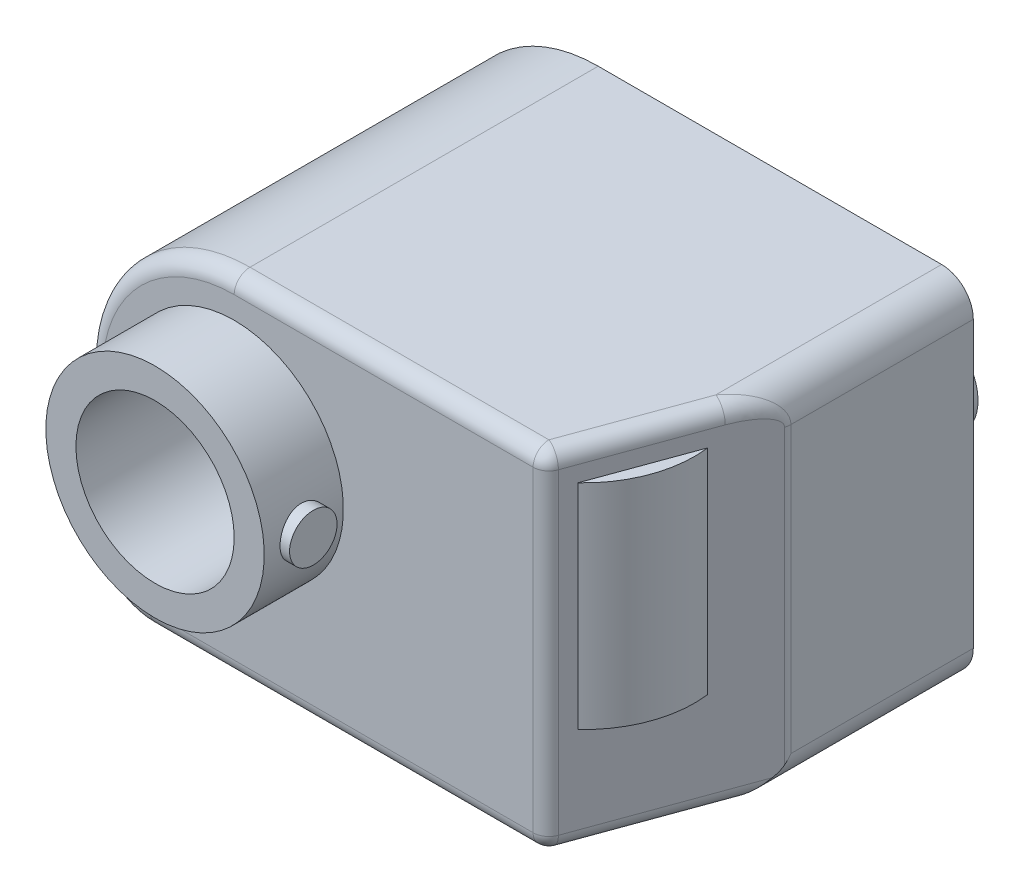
ISO-10303-21;
HEADER;
FILE_DESCRIPTION(('STEP AP214'),'2;1');
FILE_NAME('part.step','',(''),(''),'','','');
FILE_SCHEMA(('AUTOMOTIVE_DESIGN { 1 0 10303 214 1 1 1 1 }'));
ENDSEC;
DATA;
#1=APPLICATION_CONTEXT('core data for automotive mechanical design processes');
#2=APPLICATION_PROTOCOL_DEFINITION('international standard','automotive_design',2000,#1);
#3=PRODUCT_CONTEXT('',#1,'mechanical');
#4=PRODUCT('Part','Part','',(#3));
#5=PRODUCT_RELATED_PRODUCT_CATEGORY('part','',(#4));
#6=PRODUCT_DEFINITION_FORMATION('','',#4);
#7=PRODUCT_DEFINITION_CONTEXT('part definition',#1,'design');
#8=PRODUCT_DEFINITION('design','',#6,#7);
#9=PRODUCT_DEFINITION_SHAPE('','',#8);
#10=(LENGTH_UNIT() NAMED_UNIT(*) SI_UNIT(.MILLI.,.METRE.));
#11=(NAMED_UNIT(*) PLANE_ANGLE_UNIT() SI_UNIT($,.RADIAN.));
#12=(NAMED_UNIT(*) SI_UNIT($,.STERADIAN.) SOLID_ANGLE_UNIT());
#13=UNCERTAINTY_MEASURE_WITH_UNIT(LENGTH_MEASURE(1.E-05),#10,'distance_accuracy_value','');
#14=(GEOMETRIC_REPRESENTATION_CONTEXT(3) GLOBAL_UNCERTAINTY_ASSIGNED_CONTEXT((#13)) GLOBAL_UNIT_ASSIGNED_CONTEXT((#10,
#11,#12)) REPRESENTATION_CONTEXT('',''));
#15=CARTESIAN_POINT('',(0.,0.,0.));
#16=DIRECTION('',(0.,0.,1.));
#17=DIRECTION('',(1.,0.,0.));
#18=AXIS2_PLACEMENT_3D('',#15,#16,#17);
#19=CARTESIAN_POINT('',(18.,0.,-5.));
#20=DIRECTION('',(0.,0.,1.));
#21=DIRECTION('',(0.,-1.,0.));
#22=AXIS2_PLACEMENT_3D('',#19,#20,#21);
#23=CYLINDRICAL_SURFACE('',#22,3.);
#24=CARTESIAN_POINT('',(18.,0.,0.));
#25=DIRECTION('',(0.,0.,1.));
#26=DIRECTION('',(0.,-1.,0.));
#27=AXIS2_PLACEMENT_3D('',#24,#25,#26);
#28=CIRCLE('',#27,3.);
#29=CARTESIAN_POINT('',(18.,-3.,0.));
#30=VERTEX_POINT('',#29);
#31=EDGE_CURVE('E145',#30,#30,#28,.T.);
#32=ORIENTED_EDGE('',*,*,#31,.F.);
#33=EDGE_LOOP('',(#32));
#34=FACE_BOUND('',#33,.T.);
#35=CARTESIAN_POINT('',(18.,0.,-3.));
#36=DIRECTION('',(0.,0.,-1.));
#37=DIRECTION('',(-1.,0.,0.));
#38=AXIS2_PLACEMENT_3D('',#35,#36,#37);
#39=CIRCLE('',#38,3.);
#40=CARTESIAN_POINT('',(15.,0.,-3.));
#41=VERTEX_POINT('',#40);
#42=EDGE_CURVE('E736',#41,#41,#39,.T.);
#43=ORIENTED_EDGE('',*,*,#42,.F.);
#44=EDGE_LOOP('',(#43));
#45=FACE_BOUND('',#44,.T.);
#46=ADVANCED_FACE('F14',(#34,#45),#23,.T.);
#47=CARTESIAN_POINT('',(-5.3,-8.7,0.));
#48=DIRECTION('',(0.,0.,1.));
#49=DIRECTION('',(0.,-1.,0.));
#50=AXIS2_PLACEMENT_3D('',#47,#48,#49);
#51=PLANE('',#50);
#52=ORIENTED_EDGE('',*,*,#31,.T.);
#53=EDGE_LOOP('',(#52));
#54=FACE_BOUND('',#53,.T.);
#55=CARTESIAN_POINT('',(-5.3,-8.7,0.));
#56=DIRECTION('',(0.,0.,1.));
#57=DIRECTION('',(0.,-1.,0.));
#58=AXIS2_PLACEMENT_3D('',#55,#56,#57);
#59=CIRCLE('',#58,4.);
#60=CARTESIAN_POINT('',(-9.3,-8.7,0.));
#61=VERTEX_POINT('',#60);
#62=CARTESIAN_POINT('',(-5.3,-12.7,0.));
#63=VERTEX_POINT('',#62);
#64=EDGE_CURVE('E419',#61,#63,#59,.T.);
#65=ORIENTED_EDGE('',*,*,#64,.F.);
#66=DIRECTION('',(0.,-1.,0.));
#67=VECTOR('',#66,1.);
#68=CARTESIAN_POINT('',(-9.3,0.,0.));
#69=LINE('',#68,#67);
#70=CARTESIAN_POINT('',(-9.3,0.,0.));
#71=VERTEX_POINT('',#70);
#72=EDGE_CURVE('E437',#71,#61,#69,.T.);
#73=ORIENTED_EDGE('',*,*,#72,.F.);
#74=CARTESIAN_POINT('',(0.,0.,0.));
#75=DIRECTION('',(0.,0.,1.));
#76=DIRECTION('',(0.,-1.,0.));
#77=AXIS2_PLACEMENT_3D('',#74,#75,#76);
#78=CIRCLE('',#77,9.3);
#79=CARTESIAN_POINT('',(0.,9.3,0.));
#80=VERTEX_POINT('',#79);
#81=EDGE_CURVE('E434',#80,#71,#78,.T.);
#82=ORIENTED_EDGE('',*,*,#81,.F.);
#83=DIRECTION('',(-1.,0.,0.));
#84=VECTOR('',#83,1.);
#85=CARTESIAN_POINT('',(0.,9.3,0.));
#86=LINE('',#85,#84);
#87=CARTESIAN_POINT('',(21.6999999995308,9.3,0.));
#88=VERTEX_POINT('',#87);
#89=EDGE_CURVE('E431',#88,#80,#86,.T.);
#90=ORIENTED_EDGE('',*,*,#89,.F.);
#91=CARTESIAN_POINT('',(21.6999999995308,7.3,0.));
#92=DIRECTION('',(0.,0.,1.));
#93=DIRECTION('',(0.,1.,0.));
#94=AXIS2_PLACEMENT_3D('',#91,#92,#93);
#95=CIRCLE('',#94,2.);
#96=CARTESIAN_POINT('',(23.6999999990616,7.30004332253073,0.));
#97=VERTEX_POINT('',#96);
#98=EDGE_CURVE('E428',#97,#88,#95,.T.);
#99=ORIENTED_EDGE('',*,*,#98,.F.);
#100=DIRECTION('',(-2.16612653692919E-05,0.999999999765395,0.));
#101=VECTOR('',#100,1.);
#102=CARTESIAN_POINT('',(23.6999999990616,7.30004332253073,0.));
#103=LINE('',#102,#101);
#104=CARTESIAN_POINT('',(23.7003899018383,-10.6999566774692,0.));
#105=VERTEX_POINT('',#104);
#106=EDGE_CURVE('E425',#105,#97,#103,.T.);
#107=ORIENTED_EDGE('',*,*,#106,.F.);
#108=CARTESIAN_POINT('',(21.7003899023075,-10.7,0.));
#109=DIRECTION('',(0.,0.,1.));
#110=DIRECTION('',(0.,1.,0.));
#111=AXIS2_PLACEMENT_3D('',#108,#109,#110);
#112=CIRCLE('',#111,2.);
#113=CARTESIAN_POINT('',(21.7003899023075,-12.7,0.));
#114=VERTEX_POINT('',#113);
#115=EDGE_CURVE('E423',#114,#105,#112,.T.);
#116=ORIENTED_EDGE('',*,*,#115,.F.);
#117=DIRECTION('',(1.,0.,0.));
#118=VECTOR('',#117,1.);
#119=CARTESIAN_POINT('',(-5.3,-12.7,0.));
#120=LINE('',#119,#118);
#121=EDGE_CURVE('E354',#63,#114,#120,.T.);
#122=ORIENTED_EDGE('',*,*,#121,.F.);
#123=EDGE_LOOP('',(#65,#73,#82,#90,#99,#107,#116,#122));
#124=FACE_BOUND('',#123,.T.);
#125=CARTESIAN_POINT('',(0.,0.,0.));
#126=DIRECTION('',(0.,0.,1.));
#127=DIRECTION('',(0.,-1.,0.));
#128=AXIS2_PLACEMENT_3D('',#125,#126,#127);
#129=CIRCLE('',#128,8.);
#130=CARTESIAN_POINT('',(0.,-8.,0.));
#131=VERTEX_POINT('',#130);
#132=EDGE_CURVE('E408',#131,#131,#129,.T.);
#133=ORIENTED_EDGE('',*,*,#132,.T.);
#134=EDGE_LOOP('',(#133));
#135=FACE_BOUND('',#134,.T.);
#136=ADVANCED_FACE('F211',(#54,#124,#135),#51,.F.);
#137=CARTESIAN_POINT('',(-5.3,-8.7,23.));
#138=DIRECTION('',(0.,0.,-1.));
#139=DIRECTION('',(0.,1.,0.));
#140=AXIS2_PLACEMENT_3D('',#137,#138,#139);
#141=CYLINDRICAL_SURFACE('',#140,4.);
#142=DIRECTION('',(0.,0.,-1.));
#143=VECTOR('',#142,1.);
#144=CARTESIAN_POINT('',(-5.3,-12.7,23.));
#145=LINE('',#144,#143);
#146=CARTESIAN_POINT('',(-5.3,-12.7,22.));
#147=VERTEX_POINT('',#146);
#148=EDGE_CURVE('E284',#147,#63,#145,.T.);
#149=ORIENTED_EDGE('',*,*,#148,.F.);
#150=CARTESIAN_POINT('',(-5.3,-8.7,22.));
#151=DIRECTION('',(0.,0.,1.));
#152=DIRECTION('',(0.,-1.,0.));
#153=AXIS2_PLACEMENT_3D('',#150,#151,#152);
#154=CIRCLE('',#153,4.);
#155=CARTESIAN_POINT('',(-9.3,-8.7,22.));
#156=VERTEX_POINT('',#155);
#157=EDGE_CURVE('E308',#147,#156,#154,.F.);
#158=ORIENTED_EDGE('',*,*,#157,.T.);
#159=DIRECTION('',(0.,0.,-1.));
#160=VECTOR('',#159,1.);
#161=CARTESIAN_POINT('',(-9.3,-8.7,23.));
#162=LINE('',#161,#160);
#163=EDGE_CURVE('E440',#156,#61,#162,.T.);
#164=ORIENTED_EDGE('',*,*,#163,.T.);
#165=ORIENTED_EDGE('',*,*,#64,.T.);
#166=EDGE_LOOP('',(#149,#158,#164,#165));
#167=FACE_BOUND('',#166,.T.);
#168=ADVANCED_FACE('F16',(#167),#141,.T.);
#169=CARTESIAN_POINT('',(-5.3,-12.7,23.));
#170=DIRECTION('',(0.,1.,0.));
#171=DIRECTION('',(-1.,0.,0.));
#172=AXIS2_PLACEMENT_3D('',#169,#170,#171);
#173=PLANE('',#172);
#174=DIRECTION('',(0.,0.,-1.));
#175=VECTOR('',#174,1.);
#176=CARTESIAN_POINT('',(21.7003899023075,-12.7,23.));
#177=LINE('',#176,#175);
#178=CARTESIAN_POINT('',(21.7003899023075,-12.7,14.2700791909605));
#179=VERTEX_POINT('',#178);
#180=EDGE_CURVE('E282',#179,#114,#177,.T.);
#181=ORIENTED_EDGE('',*,*,#180,.F.);
#182=DIRECTION('',(-0.342020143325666,0.,0.939692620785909));
#183=VECTOR('',#182,1.);
#184=CARTESIAN_POINT('',(15.7362018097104,-12.7,30.6565513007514));
#185=LINE('',#184,#183);
#186=CARTESIAN_POINT('',(18.8869288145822,-12.7,22.));
#187=VERTEX_POINT('',#186);
#188=EDGE_CURVE('E314',#179,#187,#185,.T.);
#189=ORIENTED_EDGE('',*,*,#188,.T.);
#190=DIRECTION('',(1.,0.,0.));
#191=VECTOR('',#190,1.);
#192=CARTESIAN_POINT('',(-5.3,-12.7,22.));
#193=LINE('',#192,#191);
#194=EDGE_CURVE('E306',#187,#147,#193,.F.);
#195=ORIENTED_EDGE('',*,*,#194,.T.);
#196=ORIENTED_EDGE('',*,*,#148,.T.);
#197=ORIENTED_EDGE('',*,*,#121,.T.);
#198=EDGE_LOOP('',(#181,#189,#195,#196,#197));
#199=FACE_BOUND('',#198,.T.);
#200=ADVANCED_FACE('F340',(#199),#173,.F.);
#201=CARTESIAN_POINT('',(21.7003899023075,-10.7,23.));
#202=DIRECTION('',(0.,0.,-1.));
#203=DIRECTION('',(0.,1.,0.));
#204=AXIS2_PLACEMENT_3D('',#201,#202,#203);
#205=CYLINDRICAL_SURFACE('',#204,2.);
#206=CARTESIAN_POINT('',(21.7003899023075,-10.7,17.1938835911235));
#207=DIRECTION('',(-0.939692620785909,0.,-0.342020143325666));
#208=DIRECTION('',(0.342020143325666,0.,-0.939692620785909));
#209=AXIS2_PLACEMENT_3D('',#206,#207,#208);
#210=ELLIPSE('',#209,5.84760880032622,2.);
#211=CARTESIAN_POINT('',(23.6400930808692,-11.1873926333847,11.8645929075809));
#212=VERTEX_POINT('',#211);
#213=CARTESIAN_POINT('',(23.4324407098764,-11.7,12.4351131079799));
#214=VERTEX_POINT('',#213);
#215=EDGE_CURVE('E393',#212,#214,#210,.T.);
#216=ORIENTED_EDGE('',*,*,#215,.T.);
#217=CARTESIAN_POINT('',(23.4324407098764,-11.7,12.4351131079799));
#218=CARTESIAN_POINT('',(23.4076435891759,-11.7429748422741,12.5033279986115));
#219=CARTESIAN_POINT('',(23.3803123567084,-11.7865955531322,12.5702335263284));
#220=CARTESIAN_POINT('',(23.3202990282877,-11.8741812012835,12.7013998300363));
#221=CARTESIAN_POINT('',(23.2876151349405,-11.9181462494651,12.7656597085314));
#222=CARTESIAN_POINT('',(23.2165334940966,-12.0055617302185,12.8916340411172));
#223=CARTESIAN_POINT('',(23.1781204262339,-12.0490104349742,12.9533410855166));
#224=CARTESIAN_POINT('',(23.0956015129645,-12.1341897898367,13.0740661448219));
#225=CARTESIAN_POINT('',(23.0514962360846,-12.1759206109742,13.1330844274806));
#226=CARTESIAN_POINT('',(22.9503425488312,-12.2629254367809,13.2576519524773));
#227=CARTESIAN_POINT('',(22.8923493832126,-12.3077253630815,13.3227696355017));
#228=CARTESIAN_POINT('',(22.7694443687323,-12.3919437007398,13.4499293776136));
#229=CARTESIAN_POINT('',(22.7045306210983,-12.4313606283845,13.511970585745));
#230=CARTESIAN_POINT('',(22.5689261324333,-12.503194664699,13.6332098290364));
#231=CARTESIAN_POINT('',(22.4982558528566,-12.5356351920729,13.6924168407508));
#232=CARTESIAN_POINT('',(22.3521671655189,-12.5924386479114,13.8087321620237));
#233=CARTESIAN_POINT('',(22.2767513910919,-12.6168060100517,13.865841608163));
#234=CARTESIAN_POINT('',(22.1215572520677,-12.6568146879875,13.9793436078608));
#235=CARTESIAN_POINT('',(22.0417351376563,-12.6723392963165,14.0357173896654));
#236=CARTESIAN_POINT('',(21.8803128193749,-12.6935502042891,14.1476502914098));
#237=CARTESIAN_POINT('',(21.7987145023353,-12.6992464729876,14.2032101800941));
#238=CARTESIAN_POINT('',(21.7115365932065,-12.699976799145,14.2624990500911));
#239=CARTESIAN_POINT('',(21.7059631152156,-12.7000001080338,14.2662892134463));
#240=CARTESIAN_POINT('',(21.7003899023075,-12.7,14.2700791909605));
#241=B_SPLINE_CURVE_WITH_KNOTS('',3,(#217,#218,#219,#220,#221,#222,#223,#224,#225,#226,#227,
#228,#229,#230,#231,#232,#233,#234,#235,#236,#237,#238,#239,#240),.UNSPECIFIED.,.F.,.F.,(4,2,2,
2,2,2,2,2,2,2,2,4),(0.,0.253025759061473,0.506136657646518,0.759936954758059,1.01371192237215,
1.30737558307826,1.60112002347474,1.89386246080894,2.18644386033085,2.48280226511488,
2.77885989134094,2.79908013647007),.UNSPECIFIED.);
#242=EDGE_CURVE('E331',#214,#179,#241,.T.);
#243=ORIENTED_EDGE('',*,*,#242,.T.);
#244=ORIENTED_EDGE('',*,*,#180,.T.);
#245=ORIENTED_EDGE('',*,*,#115,.T.);
#246=DIRECTION('',(0.,0.,-1.));
#247=VECTOR('',#246,1.);
#248=CARTESIAN_POINT('',(23.7003899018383,-10.6999566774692,23.));
#249=LINE('',#248,#247);
#250=CARTESIAN_POINT('',(23.7003899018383,-10.6999566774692,11.5226017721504));
#251=VERTEX_POINT('',#250);
#252=EDGE_CURVE('E274',#251,#105,#249,.T.);
#253=ORIENTED_EDGE('',*,*,#252,.F.);
#254=CARTESIAN_POINT('',(23.6400930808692,-11.1873926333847,11.8645929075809));
#255=CARTESIAN_POINT('',(23.6600435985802,-11.1078864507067,11.8096933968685));
#256=CARTESIAN_POINT('',(23.6749937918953,-11.0278204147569,11.7537451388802));
#257=CARTESIAN_POINT('',(23.6949905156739,-10.8675738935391,11.6411085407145));
#258=CARTESIAN_POINT('',(23.70008619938,-10.7873959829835,11.5844253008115));
#259=CARTESIAN_POINT('',(23.7003855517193,-10.7048254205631,11.5260442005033));
#260=CARTESIAN_POINT('',(23.7003899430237,-10.7023910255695,11.5243229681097));
#261=CARTESIAN_POINT('',(23.7003899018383,-10.6999566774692,11.5226017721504));
#262=B_SPLINE_CURVE_WITH_KNOTS('',3,(#254,#255,#256,#257,#258,#259,#260,#261),.UNSPECIFIED.,.F.,
.F.,(4,2,2,4),(0.,0.295905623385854,0.590331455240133,0.599275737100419),.UNSPECIFIED.);
#263=EDGE_CURVE('E325',#251,#212,#262,.F.);
#264=ORIENTED_EDGE('',*,*,#263,.T.);
#265=EDGE_LOOP('',(#216,#243,#244,#245,#253,#264));
#266=FACE_BOUND('',#265,.T.);
#267=ADVANCED_FACE('F336',(#266),#205,.T.);
#268=CARTESIAN_POINT('',(23.6999999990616,7.30004332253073,23.));
#269=DIRECTION('',(-0.999999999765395,-2.16612653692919E-05,0.));
#270=DIRECTION('',(2.16612653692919E-05,-0.999999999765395,0.));
#271=AXIS2_PLACEMENT_3D('',#268,#269,#270);
#272=PLANE('',#271);
#273=DIRECTION('',(0.,0.,-1.));
#274=VECTOR('',#273,1.);
#275=CARTESIAN_POINT('',(23.6999999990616,7.30004332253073,23.));
#276=LINE('',#275,#274);
#277=CARTESIAN_POINT('',(23.6999999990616,7.30004332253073,11.5236730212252));
#278=VERTEX_POINT('',#277);
#279=EDGE_CURVE('E271',#278,#97,#276,.T.);
#280=ORIENTED_EDGE('',*,*,#279,.F.);
#281=DIRECTION('',(2.16612653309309E-05,-0.999999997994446,-5.95138373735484E-05));
#282=VECTOR('',#281,1.);
#283=CARTESIAN_POINT('',(23.699999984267,7.30072632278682,11.5236730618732));
#284=LINE('',#283,#282);
#285=EDGE_CURVE('E266',#278,#251,#284,.T.);
#286=ORIENTED_EDGE('',*,*,#285,.T.);
#287=ORIENTED_EDGE('',*,*,#252,.T.);
#288=ORIENTED_EDGE('',*,*,#106,.T.);
#289=EDGE_LOOP('',(#280,#286,#287,#288));
#290=FACE_BOUND('',#289,.T.);
#291=ADVANCED_FACE('F339',(#290),#272,.F.);
#292=CARTESIAN_POINT('',(21.6999999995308,7.3,23.));
#293=DIRECTION('',(0.,0.,-1.));
#294=DIRECTION('',(0.,1.,0.));
#295=AXIS2_PLACEMENT_3D('',#292,#293,#294);
#296=CYLINDRICAL_SURFACE('',#295,2.);
#297=DIRECTION('',(0.,0.,-1.));
#298=VECTOR('',#297,1.);
#299=CARTESIAN_POINT('',(21.6999999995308,9.3,23.));
#300=LINE('',#299,#298);
#301=CARTESIAN_POINT('',(21.6999999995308,9.3,14.2711504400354));
#302=VERTEX_POINT('',#301);
#303=EDGE_CURVE('E275',#302,#88,#300,.T.);
#304=ORIENTED_EDGE('',*,*,#303,.F.);
#305=CARTESIAN_POINT('',(21.6999999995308,7.3,14.2711504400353));
#306=DIRECTION('',(0.808479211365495,0.,0.588524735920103));
#307=DIRECTION('',(0.588524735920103,0.,-0.808479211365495));
#308=AXIS2_PLACEMENT_3D('',#305,#306,#307);
#309=ELLIPSE('',#308,3.39832784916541,2.);
#310=EDGE_CURVE('E268',#302,#278,#309,.F.);
#311=ORIENTED_EDGE('',*,*,#310,.T.);
#312=ORIENTED_EDGE('',*,*,#279,.T.);
#313=ORIENTED_EDGE('',*,*,#98,.T.);
#314=EDGE_LOOP('',(#304,#311,#312,#313));
#315=FACE_BOUND('',#314,.T.);
#316=ADVANCED_FACE('F179',(#315),#296,.T.);
#317=CARTESIAN_POINT('',(0.,9.3,23.));
#318=DIRECTION('',(0.,-1.,0.));
#319=DIRECTION('',(1.,0.,0.));
#320=AXIS2_PLACEMENT_3D('',#317,#318,#319);
#321=PLANE('',#320);
#322=DIRECTION('',(-1.,0.,0.));
#323=VECTOR('',#322,1.);
#324=CARTESIAN_POINT('',(-5.3,9.3,22.));
#325=LINE('',#324,#323);
#326=CARTESIAN_POINT('',(0.,9.3,22.));
#327=VERTEX_POINT('',#326);
#328=CARTESIAN_POINT('',(18.8869288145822,9.3,22.));
#329=VERTEX_POINT('',#328);
#330=EDGE_CURVE('E304',#327,#329,#325,.F.);
#331=ORIENTED_EDGE('',*,*,#330,.T.);
#332=DIRECTION('',(0.342020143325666,0.,-0.939692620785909));
#333=VECTOR('',#332,1.);
#334=CARTESIAN_POINT('',(16.3561840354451,9.3,28.953164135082));
#335=LINE('',#334,#333);
#336=EDGE_CURVE('E270',#329,#302,#335,.T.);
#337=ORIENTED_EDGE('',*,*,#336,.T.);
#338=ORIENTED_EDGE('',*,*,#303,.T.);
#339=ORIENTED_EDGE('',*,*,#89,.T.);
#340=DIRECTION('',(0.,0.,-1.));
#341=VECTOR('',#340,1.);
#342=CARTESIAN_POINT('',(0.,9.3,23.));
#343=LINE('',#342,#341);
#344=EDGE_CURVE('E443',#327,#80,#343,.T.);
#345=ORIENTED_EDGE('',*,*,#344,.F.);
#346=EDGE_LOOP('',(#331,#337,#338,#339,#345));
#347=FACE_BOUND('',#346,.T.);
#348=ADVANCED_FACE('F449',(#347),#321,.F.);
#349=CARTESIAN_POINT('',(0.,0.,23.));
#350=DIRECTION('',(0.,0.,-1.));
#351=DIRECTION('',(0.,1.,0.));
#352=AXIS2_PLACEMENT_3D('',#349,#350,#351);
#353=CYLINDRICAL_SURFACE('',#352,9.3);
#354=DIRECTION('',(0.,0.,-1.));
#355=VECTOR('',#354,1.);
#356=CARTESIAN_POINT('',(-9.3,0.,23.));
#357=LINE('',#356,#355);
#358=CARTESIAN_POINT('',(-9.3,0.,22.));
#359=VERTEX_POINT('',#358);
#360=EDGE_CURVE('E442',#359,#71,#357,.T.);
#361=ORIENTED_EDGE('',*,*,#360,.F.);
#362=CARTESIAN_POINT('',(0.,0.,22.));
#363=DIRECTION('',(0.,0.,1.));
#364=DIRECTION('',(0.,-1.,0.));
#365=AXIS2_PLACEMENT_3D('',#362,#363,#364);
#366=CIRCLE('',#365,9.3);
#367=EDGE_CURVE('E312',#359,#327,#366,.F.);
#368=ORIENTED_EDGE('',*,*,#367,.T.);
#369=ORIENTED_EDGE('',*,*,#344,.T.);
#370=ORIENTED_EDGE('',*,*,#81,.T.);
#371=EDGE_LOOP('',(#361,#368,#369,#370));
#372=FACE_BOUND('',#371,.T.);
#373=ADVANCED_FACE('F462',(#372),#353,.T.);
#374=CARTESIAN_POINT('',(-9.3,0.,23.));
#375=DIRECTION('',(1.,0.,0.));
#376=DIRECTION('',(0.,0.,1.));
#377=AXIS2_PLACEMENT_3D('',#374,#375,#376);
#378=PLANE('',#377);
#379=ORIENTED_EDGE('',*,*,#163,.F.);
#380=DIRECTION('',(0.,-1.,0.));
#381=VECTOR('',#380,1.);
#382=CARTESIAN_POINT('',(-9.3,-8.7,22.));
#383=LINE('',#382,#381);
#384=EDGE_CURVE('E310',#156,#359,#383,.F.);
#385=ORIENTED_EDGE('',*,*,#384,.T.);
#386=ORIENTED_EDGE('',*,*,#360,.T.);
#387=ORIENTED_EDGE('',*,*,#72,.T.);
#388=EDGE_LOOP('',(#379,#385,#386,#387));
#389=FACE_BOUND('',#388,.T.);
#390=ADVANCED_FACE('F465',(#389),#378,.F.);
#391=CARTESIAN_POINT('',(-5.3,-8.7,23.));
#392=DIRECTION('',(0.,0.,1.));
#393=DIRECTION('',(0.,-1.,0.));
#394=AXIS2_PLACEMENT_3D('',#391,#392,#393);
#395=PLANE('',#394);
#396=DIRECTION('',(1.,0.,0.));
#397=VECTOR('',#396,1.);
#398=CARTESIAN_POINT('',(-5.3,-11.7,23.));
#399=LINE('',#398,#397);
#400=CARTESIAN_POINT('',(-5.3,-11.7,23.));
#401=VERTEX_POINT('',#400);
#402=CARTESIAN_POINT('',(18.8869288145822,-11.7,23.));
#403=VERTEX_POINT('',#402);
#404=EDGE_CURVE('E296',#401,#403,#399,.T.);
#405=ORIENTED_EDGE('',*,*,#404,.T.);
#406=DIRECTION('',(0.,-1.,0.));
#407=VECTOR('',#406,1.);
#408=CARTESIAN_POINT('',(18.8869288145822,15.,23.));
#409=LINE('',#408,#407);
#410=CARTESIAN_POINT('',(18.8869288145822,8.3,23.));
#411=VERTEX_POINT('',#410);
#412=EDGE_CURVE('E301',#403,#411,#409,.F.);
#413=ORIENTED_EDGE('',*,*,#412,.T.);
#414=DIRECTION('',(-1.,0.,0.));
#415=VECTOR('',#414,1.);
#416=CARTESIAN_POINT('',(-5.3,8.3,23.));
#417=LINE('',#416,#415);
#418=CARTESIAN_POINT('',(0.,8.3,23.));
#419=VERTEX_POINT('',#418);
#420=EDGE_CURVE('E299',#411,#419,#417,.T.);
#421=ORIENTED_EDGE('',*,*,#420,.T.);
#422=CARTESIAN_POINT('',(0.,0.,23.));
#423=DIRECTION('',(0.,0.,1.));
#424=DIRECTION('',(0.,-1.,0.));
#425=AXIS2_PLACEMENT_3D('',#422,#423,#424);
#426=CIRCLE('',#425,8.3);
#427=CARTESIAN_POINT('',(-8.3,0.,23.));
#428=VERTEX_POINT('',#427);
#429=EDGE_CURVE('E290',#419,#428,#426,.T.);
#430=ORIENTED_EDGE('',*,*,#429,.T.);
#431=DIRECTION('',(0.,-1.,0.));
#432=VECTOR('',#431,1.);
#433=CARTESIAN_POINT('',(-8.3,-8.7,23.));
#434=LINE('',#433,#432);
#435=CARTESIAN_POINT('',(-8.3,-8.7,23.));
#436=VERTEX_POINT('',#435);
#437=EDGE_CURVE('E292',#428,#436,#434,.T.);
#438=ORIENTED_EDGE('',*,*,#437,.T.);
#439=CARTESIAN_POINT('',(-5.3,-8.7,23.));
#440=DIRECTION('',(0.,0.,1.));
#441=DIRECTION('',(0.,-1.,0.));
#442=AXIS2_PLACEMENT_3D('',#439,#440,#441);
#443=CIRCLE('',#442,3.);
#444=EDGE_CURVE('E294',#436,#401,#443,.T.);
#445=ORIENTED_EDGE('',*,*,#444,.T.);
#446=EDGE_LOOP('',(#405,#413,#421,#430,#438,#445));
#447=FACE_BOUND('',#446,.T.);
#448=CARTESIAN_POINT('',(0.,0.,23.));
#449=DIRECTION('',(0.,0.,1.));
#450=DIRECTION('',(0.,-1.,0.));
#451=AXIS2_PLACEMENT_3D('',#448,#449,#450);
#452=CIRCLE('',#451,6.9);
#453=CARTESIAN_POINT('',(0.,-6.9,23.));
#454=VERTEX_POINT('',#453);
#455=EDGE_CURVE('E286',#454,#454,#452,.T.);
#456=ORIENTED_EDGE('',*,*,#455,.F.);
#457=EDGE_LOOP('',(#456));
#458=FACE_BOUND('',#457,.T.);
#459=ADVANCED_FACE('F209',(#447,#458),#395,.T.);
#460=CARTESIAN_POINT('',(0.,0.,28.));
#461=DIRECTION('',(0.,0.,-1.));
#462=DIRECTION('',(0.,1.,0.));
#463=AXIS2_PLACEMENT_3D('',#460,#461,#462);
#464=CYLINDRICAL_SURFACE('',#463,6.9);
#465=CARTESIAN_POINT('',(6.9,0.,27.));
#466=CARTESIAN_POINT('',(6.89999846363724,0.0832066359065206,26.9999971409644));
#467=CARTESIAN_POINT('',(6.89847961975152,0.166447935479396,26.993053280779));
#468=CARTESIAN_POINT('',(6.89256733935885,0.330566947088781,26.9654896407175));
#469=CARTESIAN_POINT('',(6.88817183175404,0.411442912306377,26.9448600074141));
#470=CARTESIAN_POINT('',(6.87699573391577,0.56843559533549,26.8906008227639));
#471=CARTESIAN_POINT('',(6.87021762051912,0.644557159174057,26.8569847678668));
#472=CARTESIAN_POINT('',(6.8550082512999,0.790076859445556,26.7777496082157));
#473=CARTESIAN_POINT('',(6.8465770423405,0.859475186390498,26.7321308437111));
#474=CARTESIAN_POINT('',(6.82883589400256,0.990682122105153,26.629419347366));
#475=CARTESIAN_POINT('',(6.81951516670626,1.05236881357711,26.5721727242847));
#476=CARTESIAN_POINT('',(6.80112168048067,1.16534439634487,26.448160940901));
#477=CARTESIAN_POINT('',(6.79204894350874,1.21663236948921,26.3813949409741));
#478=CARTESIAN_POINT('',(6.77507239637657,1.30789114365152,26.2393400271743));
#479=CARTESIAN_POINT('',(6.76718241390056,1.34773241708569,26.1639661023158));
#480=CARTESIAN_POINT('',(6.75361942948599,1.41413606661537,26.0073931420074));
#481=CARTESIAN_POINT('',(6.7479461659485,1.44070000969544,25.9261947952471));
#482=CARTESIAN_POINT('',(6.73956878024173,1.47939254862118,25.7615996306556));
#483=CARTESIAN_POINT('',(6.73682033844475,1.49173685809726,25.6782558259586));
#484=CARTESIAN_POINT('',(6.73447065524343,1.50231040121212,25.5106383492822));
#485=CARTESIAN_POINT('',(6.73486903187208,1.50054134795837,25.4263647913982));
#486=CARTESIAN_POINT('',(6.73872783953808,1.48311203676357,25.2608818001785));
#487=CARTESIAN_POINT('',(6.74213308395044,1.467702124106,25.1796445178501));
#488=CARTESIAN_POINT('',(6.75153471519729,1.42382503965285,25.0209365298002));
#489=CARTESIAN_POINT('',(6.75753124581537,1.39535714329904,24.9434660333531));
#490=CARTESIAN_POINT('',(6.77149432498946,1.32594164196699,24.7937856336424));
#491=CARTESIAN_POINT('',(6.77947601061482,1.28489755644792,24.7216219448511));
#492=CARTESIAN_POINT('',(6.79650074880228,1.19156262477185,24.5851134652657));
#493=CARTESIAN_POINT('',(6.80554394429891,1.13927026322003,24.5207697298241));
#494=CARTESIAN_POINT('',(6.82390971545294,1.02359684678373,24.4002860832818));
#495=CARTESIAN_POINT('',(6.83323413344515,0.960002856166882,24.3443506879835));
#496=CARTESIAN_POINT('',(6.85093580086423,0.824231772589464,24.2439057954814));
#497=CARTESIAN_POINT('',(6.85931303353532,0.752054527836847,24.1993965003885));
#498=CARTESIAN_POINT('',(6.87420311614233,0.60091781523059,24.1230176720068));
#499=CARTESIAN_POINT('',(6.88071204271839,0.521944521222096,24.0911746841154));
#500=CARTESIAN_POINT('',(6.89110292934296,0.359595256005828,24.0412675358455));
#501=CARTESIAN_POINT('',(6.89498526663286,0.276219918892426,24.0232013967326));
#502=CARTESIAN_POINT('',(6.89963193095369,0.109187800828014,24.0016576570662));
#503=CARTESIAN_POINT('',(6.90045596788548,0.025568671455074,23.9979006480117));
#504=CARTESIAN_POINT('',(6.89906039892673,-0.141102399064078,24.0043248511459));
#505=CARTESIAN_POINT('',(6.89684099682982,-0.224154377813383,24.014505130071));
#506=CARTESIAN_POINT('',(6.88964558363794,-0.386409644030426,24.0482832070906));
#507=CARTESIAN_POINT('',(6.88469964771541,-0.465644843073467,24.0717346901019));
#508=CARTESIAN_POINT('',(6.87260466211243,-0.619057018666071,24.1312272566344));
#509=CARTESIAN_POINT('',(6.8654554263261,-0.693233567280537,24.1672694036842));
#510=CARTESIAN_POINT('',(6.84959946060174,-0.835579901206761,24.2515040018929));
#511=CARTESIAN_POINT('',(6.84087215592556,-0.903650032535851,24.299860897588));
#512=CARTESIAN_POINT('',(6.8228705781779,-1.03080971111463,24.4071355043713));
#513=CARTESIAN_POINT('',(6.81359623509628,-1.08989810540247,24.466054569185));
#514=CARTESIAN_POINT('',(6.7953399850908,-1.19851973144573,24.5940624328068));
#515=CARTESIAN_POINT('',(6.78636646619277,-1.2478596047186,24.6633167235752));
#516=CARTESIAN_POINT('',(6.76992068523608,-1.33420907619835,24.809292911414));
#517=CARTESIAN_POINT('',(6.7624483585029,-1.3712192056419,24.8860144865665));
#518=CARTESIAN_POINT('',(6.74992178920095,-1.43161024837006,25.0443373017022));
#519=CARTESIAN_POINT('',(6.74485404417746,-1.45506743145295,25.1259083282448));
#520=CARTESIAN_POINT('',(6.73768574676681,-1.4879107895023,25.2919583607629));
#521=CARTESIAN_POINT('',(6.73558472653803,-1.49729918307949,25.3764369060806));
#522=CARTESIAN_POINT('',(6.73461698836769,-1.50164493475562,25.5439549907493));
#523=CARTESIAN_POINT('',(6.73568157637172,-1.49690879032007,25.6269863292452));
#524=CARTESIAN_POINT('',(6.74076988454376,-1.47382445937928,25.7910375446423));
#525=CARTESIAN_POINT('',(6.74479357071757,-1.45547642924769,25.8720574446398));
#526=CARTESIAN_POINT('',(6.75531342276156,-1.40583641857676,26.0295460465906));
#527=CARTESIAN_POINT('',(6.76180116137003,-1.37458852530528,26.1060292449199));
#528=CARTESIAN_POINT('',(6.77652152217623,-1.30007386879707,26.2527132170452));
#529=CARTESIAN_POINT('',(6.78475432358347,-1.25680587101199,26.3229133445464));
#530=CARTESIAN_POINT('',(6.80224275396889,-1.15846039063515,26.4565504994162));
#531=CARTESIAN_POINT('',(6.81151553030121,-1.1031642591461,26.5198244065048));
#532=CARTESIAN_POINT('',(6.82992331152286,-0.982775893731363,26.6362956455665));
#533=CARTESIAN_POINT('',(6.83905828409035,-0.917681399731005,26.6894906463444));
#534=CARTESIAN_POINT('',(6.85629960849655,-0.778541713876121,26.7849443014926));
#535=CARTESIAN_POINT('',(6.86439132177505,-0.704392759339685,26.8270544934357));
#536=CARTESIAN_POINT('',(6.87848777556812,-0.549909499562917,26.8981474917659));
#537=CARTESIAN_POINT('',(6.88449427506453,-0.4695804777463,26.9271413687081));
#538=CARTESIAN_POINT('',(6.8926647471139,-0.324303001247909,26.9659780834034));
#539=CARTESIAN_POINT('',(6.89539849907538,-0.260143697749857,26.9787120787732));
#540=CARTESIAN_POINT('',(6.89906668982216,-0.130663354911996,26.9957239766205));
#541=CARTESIAN_POINT('',(6.90000120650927,-0.0653423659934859,27.0000022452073));
#542=CARTESIAN_POINT('',(6.9,0.,27.));
#543=B_SPLINE_CURVE_WITH_KNOTS('',3,(#465,#466,#467,#468,#469,#470,#471,#472,#473,#474,#475,
#476,#477,#478,#479,#480,#481,#482,#483,#484,#485,#486,#487,#488,#489,#490,#491,#492,#493,#494,
#495,#496,#497,#498,#499,#500,#501,#502,#503,#504,#505,#506,#507,#508,#509,#510,#511,#512,#513,
#514,#515,#516,#517,#518,#519,#520,#521,#522,#523,#524,#525,#526,#527,#528,#529,#530,#531,#532,
#533,#534,#535,#536,#537,#538,#539,#540,#541,#542),.UNSPECIFIED.,.T.,.F.,(4,2,2,2,2,2,2,2,2,2,2,
2,2,2,2,2,2,2,2,2,2,2,2,2,2,2,2,2,2,2,2,2,2,2,2,2,2,2,4),(0.,0.249380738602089,
0.498941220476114,0.748243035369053,0.997537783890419,1.25037642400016,1.50323737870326,
1.75885608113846,2.01444460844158,2.26610253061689,2.5177299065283,2.7648328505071,
3.01194950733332,3.2610115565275,3.51010718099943,3.76452178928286,4.01894089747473,
4.27389042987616,4.52880333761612,4.77871235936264,5.0286046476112,5.27579409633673,
5.52300443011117,5.77370688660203,6.02444149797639,6.27973695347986,6.53502140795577,
6.78885488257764,7.04264832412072,7.29097489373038,7.53929861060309,7.78678057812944,
8.03428797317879,8.28673978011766,8.53924990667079,8.79498727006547,9.05050837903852,
9.24635613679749,9.44219541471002),.UNSPECIFIED.);
#544=CARTESIAN_POINT('',(6.9,0.,27.));
#545=VERTEX_POINT('',#544);
#546=EDGE_CURVE('E213',#545,#545,#543,.T.);
#547=ORIENTED_EDGE('',*,*,#546,.T.);
#548=EDGE_LOOP('',(#547));
#549=FACE_BOUND('',#548,.T.);
#550=CARTESIAN_POINT('',(0.,0.,28.));
#551=DIRECTION('',(0.,0.,1.));
#552=DIRECTION('',(0.,-1.,0.));
#553=AXIS2_PLACEMENT_3D('',#550,#551,#552);
#554=CIRCLE('',#553,6.9);
#555=CARTESIAN_POINT('',(0.,-6.9,28.));
#556=VERTEX_POINT('',#555);
#557=EDGE_CURVE('E414',#556,#556,#554,.T.);
#558=ORIENTED_EDGE('',*,*,#557,.F.);
#559=EDGE_LOOP('',(#558));
#560=FACE_BOUND('',#559,.T.);
#561=ORIENTED_EDGE('',*,*,#455,.T.);
#562=EDGE_LOOP('',(#561));
#563=FACE_BOUND('',#562,.T.);
#564=ADVANCED_FACE('F204',(#549,#560,#563),#464,.T.);
#565=CARTESIAN_POINT('',(0.,0.,28.));
#566=DIRECTION('',(0.,0.,1.));
#567=DIRECTION('',(0.,-1.,0.));
#568=AXIS2_PLACEMENT_3D('',#565,#566,#567);
#569=PLANE('',#568);
#570=CARTESIAN_POINT('',(0.,0.,28.));
#571=DIRECTION('',(0.,0.,1.));
#572=DIRECTION('',(0.,-1.,0.));
#573=AXIS2_PLACEMENT_3D('',#570,#571,#572);
#574=CIRCLE('',#573,5.);
#575=CARTESIAN_POINT('',(0.,-5.,28.));
#576=VERTEX_POINT('',#575);
#577=EDGE_CURVE('E405',#576,#576,#574,.T.);
#578=ORIENTED_EDGE('',*,*,#577,.F.);
#579=EDGE_LOOP('',(#578));
#580=FACE_BOUND('',#579,.T.);
#581=ORIENTED_EDGE('',*,*,#557,.T.);
#582=EDGE_LOOP('',(#581));
#583=FACE_BOUND('',#582,.T.);
#584=ADVANCED_FACE('F200',(#580,#583),#569,.T.);
#585=CARTESIAN_POINT('',(0.,0.,5.));
#586=DIRECTION('',(0.,0.,-1.));
#587=DIRECTION('',(0.,1.,0.));
#588=AXIS2_PLACEMENT_3D('',#585,#586,#587);
#589=CYLINDRICAL_SURFACE('',#588,8.);
#590=CARTESIAN_POINT('',(0.,0.,5.));
#591=DIRECTION('',(0.,0.,1.));
#592=DIRECTION('',(0.,-1.,0.));
#593=AXIS2_PLACEMENT_3D('',#590,#591,#592);
#594=CIRCLE('',#593,8.);
#595=CARTESIAN_POINT('',(0.,-8.,5.));
#596=VERTEX_POINT('',#595);
#597=EDGE_CURVE('E411',#596,#596,#594,.T.);
#598=ORIENTED_EDGE('',*,*,#597,.T.);
#599=EDGE_LOOP('',(#598));
#600=FACE_BOUND('',#599,.T.);
#601=ORIENTED_EDGE('',*,*,#132,.F.);
#602=EDGE_LOOP('',(#601));
#603=FACE_BOUND('',#602,.T.);
#604=ADVANCED_FACE('F196',(#600,#603),#589,.F.);
#605=CARTESIAN_POINT('',(0.,0.,5.));
#606=DIRECTION('',(0.,0.,1.));
#607=DIRECTION('',(0.,-1.,0.));
#608=AXIS2_PLACEMENT_3D('',#605,#606,#607);
#609=PLANE('',#608);
#610=CARTESIAN_POINT('',(0.,0.,5.));
#611=DIRECTION('',(0.,0.,-1.));
#612=DIRECTION('',(0.,1.,0.));
#613=AXIS2_PLACEMENT_3D('',#610,#611,#612);
#614=CIRCLE('',#613,5.);
#615=CARTESIAN_POINT('',(0.,5.,5.));
#616=VERTEX_POINT('',#615);
#617=EDGE_CURVE('E397',#616,#616,#614,.T.);
#618=ORIENTED_EDGE('',*,*,#617,.F.);
#619=EDGE_LOOP('',(#618));
#620=FACE_BOUND('',#619,.T.);
#621=ORIENTED_EDGE('',*,*,#597,.F.);
#622=EDGE_LOOP('',(#621));
#623=FACE_BOUND('',#622,.T.);
#624=ADVANCED_FACE('F192',(#620,#623),#609,.F.);
#625=CARTESIAN_POINT('',(0.,0.,50.));
#626=DIRECTION('',(0.,0.,-1.));
#627=DIRECTION('',(0.,1.,0.));
#628=AXIS2_PLACEMENT_3D('',#625,#626,#627);
#629=CYLINDRICAL_SURFACE('',#628,5.);
#630=ORIENTED_EDGE('',*,*,#577,.T.);
#631=EDGE_LOOP('',(#630));
#632=FACE_BOUND('',#631,.T.);
#633=ORIENTED_EDGE('',*,*,#617,.T.);
#634=EDGE_LOOP('',(#633));
#635=FACE_BOUND('',#634,.T.);
#636=ADVANCED_FACE('F188',(#632,#635),#629,.F.);
#637=CARTESIAN_POINT('',(23.7,15.,11.7));
#638=DIRECTION('',(-0.939692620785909,0.,-0.342020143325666));
#639=DIRECTION('',(0.342020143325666,0.,-0.939692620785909));
#640=AXIS2_PLACEMENT_3D('',#637,#638,#639);
#641=PLANE('',#640);
#642=DIRECTION('',(0.,1.,0.));
#643=VECTOR('',#642,1.);
#644=CARTESIAN_POINT('',(22.3448691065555,-6.2,15.4231915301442));
#645=LINE('',#644,#643);
#646=CARTESIAN_POINT('',(22.3448691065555,-6.2,15.4231915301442));
#647=VERTEX_POINT('',#646);
#648=CARTESIAN_POINT('',(22.3448691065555,7.3,15.4231915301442));
#649=VERTEX_POINT('',#648);
#650=EDGE_CURVE('E36',#647,#649,#645,.T.);
#651=ORIENTED_EDGE('',*,*,#650,.F.);
#652=DIRECTION('',(0.342020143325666,0.,-0.939692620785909));
#653=VECTOR('',#652,1.);
#654=CARTESIAN_POINT('',(20.156476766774,-6.2,21.4357500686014));
#655=LINE('',#654,#653);
#656=CARTESIAN_POINT('',(20.156476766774,-6.2,21.4357500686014));
#657=VERTEX_POINT('',#656);
#658=EDGE_CURVE('E31',#657,#647,#655,.T.);
#659=ORIENTED_EDGE('',*,*,#658,.F.);
#660=DIRECTION('',(0.,1.,0.));
#661=VECTOR('',#660,1.);
#662=CARTESIAN_POINT('',(20.156476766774,-6.2,21.4357500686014));
#663=LINE('',#662,#661);
#664=CARTESIAN_POINT('',(20.156476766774,7.3,21.4357500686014));
#665=VERTEX_POINT('',#664);
#666=EDGE_CURVE('E131',#657,#665,#663,.T.);
#667=ORIENTED_EDGE('',*,*,#666,.T.);
#668=DIRECTION('',(0.342020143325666,0.,-0.939692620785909));
#669=VECTOR('',#668,1.);
#670=CARTESIAN_POINT('',(20.156476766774,7.3,21.4357500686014));
#671=LINE('',#670,#669);
#672=EDGE_CURVE('E136',#665,#649,#671,.T.);
#673=ORIENTED_EDGE('',*,*,#672,.T.);
#674=EDGE_LOOP('',(#651,#659,#667,#673));
#675=FACE_BOUND('',#674,.T.);
#676=DIRECTION('',(0.,-1.,0.));
#677=VECTOR('',#676,1.);
#678=CARTESIAN_POINT('',(19.8266214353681,15.,22.3420201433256));
#679=LINE('',#678,#677);
#680=CARTESIAN_POINT('',(19.8266214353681,8.3,22.3420201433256));
#681=VERTEX_POINT('',#680);
#682=CARTESIAN_POINT('',(19.8266214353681,-11.7,22.3420201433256));
#683=VERTEX_POINT('',#682);
#684=EDGE_CURVE('E287',#681,#683,#679,.T.);
#685=ORIENTED_EDGE('',*,*,#684,.T.);
#686=DIRECTION('',(-0.342020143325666,0.,0.939692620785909));
#687=VECTOR('',#686,1.);
#688=CARTESIAN_POINT('',(23.7,-11.7,11.7));
#689=LINE('',#688,#687);
#690=EDGE_CURVE('E323',#683,#214,#689,.F.);
#691=ORIENTED_EDGE('',*,*,#690,.T.);
#692=ORIENTED_EDGE('',*,*,#215,.F.);
#693=DIRECTION('',(2.16612653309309E-05,-0.999999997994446,-5.95138373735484E-05));
#694=VECTOR('',#693,1.);
#695=CARTESIAN_POINT('',(23.6395258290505,14.9999888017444,11.866151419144));
#696=LINE('',#695,#694);
#697=CARTESIAN_POINT('',(23.6396926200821,7.30002166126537,11.8656931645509));
#698=VERTEX_POINT('',#697);
#699=EDGE_CURVE('E319',#212,#698,#696,.F.);
#700=ORIENTED_EDGE('',*,*,#699,.T.);
#701=CARTESIAN_POINT('',(22.6396926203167,7.3,14.613170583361));
#702=DIRECTION('',(-0.939692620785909,0.,-0.342020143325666));
#703=DIRECTION('',(0.342020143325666,0.,-0.939692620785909));
#704=AXIS2_PLACEMENT_3D('',#701,#702,#703);
#705=ELLIPSE('',#704,2.92380440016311,1.);
#706=CARTESIAN_POINT('',(22.6396926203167,8.3,14.613170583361));
#707=VERTEX_POINT('',#706);
#708=EDGE_CURVE('E317',#698,#707,#705,.F.);
#709=ORIENTED_EDGE('',*,*,#708,.T.);
#710=DIRECTION('',(0.342020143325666,0.,-0.939692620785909));
#711=VECTOR('',#710,1.);
#712=CARTESIAN_POINT('',(23.7,8.3,11.7));
#713=LINE('',#712,#711);
#714=EDGE_CURVE('E321',#707,#681,#713,.F.);
#715=ORIENTED_EDGE('',*,*,#714,.T.);
#716=EDGE_LOOP('',(#685,#691,#692,#700,#709,#715));
#717=FACE_BOUND('',#716,.T.);
#718=ADVANCED_FACE('F133',(#675,#717),#641,.F.);
#719=CARTESIAN_POINT('',(-8.3,-8.7,22.));
#720=DIRECTION('',(0.,1.,0.));
#721=DIRECTION('',(0.,0.,1.));
#722=AXIS2_PLACEMENT_3D('',#719,#720,#721);
#723=CYLINDRICAL_SURFACE('',#722,1.);
#724=CARTESIAN_POINT('',(-8.3,-8.7,22.));
#725=DIRECTION('',(0.,-1.,0.));
#726=DIRECTION('',(1.,0.,0.));
#727=AXIS2_PLACEMENT_3D('',#724,#725,#726);
#728=CIRCLE('',#727,1.);
#729=EDGE_CURVE('E394',#436,#156,#728,.T.);
#730=ORIENTED_EDGE('',*,*,#729,.F.);
#731=ORIENTED_EDGE('',*,*,#437,.F.);
#732=CARTESIAN_POINT('',(-8.3,0.,22.));
#733=DIRECTION('',(0.,1.,0.));
#734=DIRECTION('',(0.,0.,1.));
#735=AXIS2_PLACEMENT_3D('',#732,#733,#734);
#736=CIRCLE('',#735,1.);
#737=EDGE_CURVE('E390',#359,#428,#736,.T.);
#738=ORIENTED_EDGE('',*,*,#737,.F.);
#739=ORIENTED_EDGE('',*,*,#384,.F.);
#740=EDGE_LOOP('',(#730,#731,#738,#739));
#741=FACE_BOUND('',#740,.T.);
#742=ADVANCED_FACE('F187',(#741),#723,.T.);
#743=CARTESIAN_POINT('',(0.,0.,22.));
#744=DIRECTION('',(0.,0.,1.));
#745=DIRECTION('',(0.,-1.,0.));
#746=AXIS2_PLACEMENT_3D('',#743,#744,#745);
#747=TOROIDAL_SURFACE('',#746,8.3,1.);
#748=ORIENTED_EDGE('',*,*,#737,.T.);
#749=ORIENTED_EDGE('',*,*,#429,.F.);
#750=CARTESIAN_POINT('',(0.,8.3,22.));
#751=DIRECTION('',(1.,0.,0.));
#752=DIRECTION('',(0.,0.,1.));
#753=AXIS2_PLACEMENT_3D('',#750,#751,#752);
#754=CIRCLE('',#753,1.);
#755=EDGE_CURVE('E382',#327,#419,#754,.T.);
#756=ORIENTED_EDGE('',*,*,#755,.F.);
#757=ORIENTED_EDGE('',*,*,#367,.F.);
#758=EDGE_LOOP('',(#748,#749,#756,#757));
#759=FACE_BOUND('',#758,.T.);
#760=ADVANCED_FACE('F387',(#759),#747,.T.);
#761=CARTESIAN_POINT('',(-5.3,-8.7,22.));
#762=DIRECTION('',(0.,0.,1.));
#763=DIRECTION('',(0.,-1.,0.));
#764=AXIS2_PLACEMENT_3D('',#761,#762,#763);
#765=TOROIDAL_SURFACE('',#764,3.,1.);
#766=ORIENTED_EDGE('',*,*,#729,.T.);
#767=ORIENTED_EDGE('',*,*,#157,.F.);
#768=CARTESIAN_POINT('',(-5.3,-11.7,22.));
#769=DIRECTION('',(1.,0.,0.));
#770=DIRECTION('',(0.,0.,1.));
#771=AXIS2_PLACEMENT_3D('',#768,#769,#770);
#772=CIRCLE('',#771,1.);
#773=EDGE_CURVE('E365',#401,#147,#772,.T.);
#774=ORIENTED_EDGE('',*,*,#773,.F.);
#775=ORIENTED_EDGE('',*,*,#444,.F.);
#776=EDGE_LOOP('',(#766,#767,#774,#775));
#777=FACE_BOUND('',#776,.T.);
#778=ADVANCED_FACE('F469',(#777),#765,.T.);
#779=CARTESIAN_POINT('',(-5.3,8.3,22.));
#780=DIRECTION('',(1.,0.,0.));
#781=DIRECTION('',(0.,1.,0.));
#782=AXIS2_PLACEMENT_3D('',#779,#780,#781);
#783=CYLINDRICAL_SURFACE('',#782,1.);
#784=ORIENTED_EDGE('',*,*,#420,.F.);
#785=CARTESIAN_POINT('',(18.8869288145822,8.3,22.));
#786=DIRECTION('',(1.,0.,0.));
#787=DIRECTION('',(0.,1.,0.));
#788=AXIS2_PLACEMENT_3D('',#785,#786,#787);
#789=CIRCLE('',#788,1.);
#790=EDGE_CURVE('E255',#411,#329,#789,.F.);
#791=ORIENTED_EDGE('',*,*,#790,.T.);
#792=ORIENTED_EDGE('',*,*,#330,.F.);
#793=ORIENTED_EDGE('',*,*,#755,.T.);
#794=EDGE_LOOP('',(#784,#791,#792,#793));
#795=FACE_BOUND('',#794,.T.);
#796=ADVANCED_FACE('F380',(#795),#783,.T.);
#797=CARTESIAN_POINT('',(-5.3,-11.7,22.));
#798=DIRECTION('',(-1.,0.,0.));
#799=DIRECTION('',(0.,-1.,0.));
#800=AXIS2_PLACEMENT_3D('',#797,#798,#799);
#801=CYLINDRICAL_SURFACE('',#800,1.);
#802=ORIENTED_EDGE('',*,*,#194,.F.);
#803=CARTESIAN_POINT('',(18.8869288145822,-11.7,22.));
#804=DIRECTION('',(-1.,0.,0.));
#805=DIRECTION('',(0.,-1.,0.));
#806=AXIS2_PLACEMENT_3D('',#803,#804,#805);
#807=CIRCLE('',#806,1.);
#808=EDGE_CURVE('E23',#187,#403,#807,.T.);
#809=ORIENTED_EDGE('',*,*,#808,.T.);
#810=ORIENTED_EDGE('',*,*,#404,.F.);
#811=ORIENTED_EDGE('',*,*,#773,.T.);
#812=EDGE_LOOP('',(#802,#809,#810,#811));
#813=FACE_BOUND('',#812,.T.);
#814=ADVANCED_FACE('F369',(#813),#801,.T.);
#815=CARTESIAN_POINT('',(18.8869288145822,15.,22.));
#816=DIRECTION('',(0.,1.,0.));
#817=DIRECTION('',(0.,0.,1.));
#818=AXIS2_PLACEMENT_3D('',#815,#816,#817);
#819=CYLINDRICAL_SURFACE('',#818,1.);
#820=ORIENTED_EDGE('',*,*,#684,.F.);
#821=CARTESIAN_POINT('',(18.8869288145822,8.3,22.));
#822=DIRECTION('',(0.,1.,0.));
#823=DIRECTION('',(0.,0.,1.));
#824=AXIS2_PLACEMENT_3D('',#821,#822,#823);
#825=CIRCLE('',#824,1.);
#826=EDGE_CURVE('E256',#681,#411,#825,.F.);
#827=ORIENTED_EDGE('',*,*,#826,.T.);
#828=ORIENTED_EDGE('',*,*,#412,.F.);
#829=CARTESIAN_POINT('',(18.8869288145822,-11.7,22.));
#830=DIRECTION('',(0.,1.,0.));
#831=DIRECTION('',(0.,0.,1.));
#832=AXIS2_PLACEMENT_3D('',#829,#830,#831);
#833=CIRCLE('',#832,1.);
#834=EDGE_CURVE('E262',#403,#683,#833,.T.);
#835=ORIENTED_EDGE('',*,*,#834,.T.);
#836=EDGE_LOOP('',(#820,#827,#828,#835));
#837=FACE_BOUND('',#836,.T.);
#838=ADVANCED_FACE('F378',(#837),#819,.T.);
#839=CARTESIAN_POINT('',(18.8869288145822,-11.7,22.));
#840=DIRECTION('',(0.,0.,1.));
#841=DIRECTION('',(0.,-1.,0.));
#842=AXIS2_PLACEMENT_3D('',#839,#840,#841);
#843=SPHERICAL_SURFACE('',#842,1.);
#844=ORIENTED_EDGE('',*,*,#834,.F.);
#845=ORIENTED_EDGE('',*,*,#808,.F.);
#846=CARTESIAN_POINT('',(18.8869288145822,-11.7,22.));
#847=DIRECTION('',(0.342020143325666,0.,-0.939692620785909));
#848=DIRECTION('',(0.939692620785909,0.,0.342020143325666));
#849=AXIS2_PLACEMENT_3D('',#846,#847,#848);
#850=CIRCLE('',#849,1.);
#851=EDGE_CURVE('E162',#683,#187,#850,.T.);
#852=ORIENTED_EDGE('',*,*,#851,.F.);
#853=EDGE_LOOP('',(#844,#845,#852));
#854=FACE_BOUND('',#853,.T.);
#855=ADVANCED_FACE('F366',(#854),#843,.T.);
#856=CARTESIAN_POINT('',(15.7362018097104,-11.7,30.6565513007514));
#857=DIRECTION('',(-0.342020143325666,0.,0.939692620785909));
#858=DIRECTION('',(-0.939692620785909,0.,-0.342020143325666));
#859=AXIS2_PLACEMENT_3D('',#856,#857,#858);
#860=CYLINDRICAL_SURFACE('',#859,1.);
#861=ORIENTED_EDGE('',*,*,#242,.F.);
#862=ORIENTED_EDGE('',*,*,#690,.F.);
#863=ORIENTED_EDGE('',*,*,#851,.T.);
#864=ORIENTED_EDGE('',*,*,#188,.F.);
#865=EDGE_LOOP('',(#861,#862,#863,#864));
#866=FACE_BOUND('',#865,.T.);
#867=ADVANCED_FACE('F359',(#866),#860,.T.);
#868=CARTESIAN_POINT('',(22.6999999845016,7.30070466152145,11.5236730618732));
#869=DIRECTION('',(2.16612653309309E-05,-0.999999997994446,-5.95138373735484E-05));
#870=DIRECTION('',(0.,5.95138373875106E-05,-0.999999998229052));
#871=AXIS2_PLACEMENT_3D('',#868,#869,#870);
#872=CYLINDRICAL_SURFACE('',#871,1.);
#873=ORIENTED_EDGE('',*,*,#263,.F.);
#874=ORIENTED_EDGE('',*,*,#285,.F.);
#875=CARTESIAN_POINT('',(22.6999999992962,7.30002166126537,11.5236730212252));
#876=DIRECTION('',(-2.16612653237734E-05,0.999999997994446,5.95138373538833E-05));
#877=DIRECTION('',(0.,-5.95138373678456E-05,0.999999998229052));
#878=AXIS2_PLACEMENT_3D('',#875,#876,#877);
#879=CIRCLE('',#878,1.);
#880=EDGE_CURVE('E159',#698,#278,#879,.T.);
#881=ORIENTED_EDGE('',*,*,#880,.F.);
#882=ORIENTED_EDGE('',*,*,#699,.F.);
#883=EDGE_LOOP('',(#873,#874,#881,#882));
#884=FACE_BOUND('',#883,.T.);
#885=ADVANCED_FACE('F174',(#884),#872,.T.);
#886=CARTESIAN_POINT('',(23.6396926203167,7.3,11.8656931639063));
#887=CARTESIAN_POINT('',(23.6696155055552,7.3,11.7834807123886));
#888=CARTESIAN_POINT('',(23.684807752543,7.3,11.6973211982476));
#889=CARTESIAN_POINT('',(23.6999999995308,7.3,11.6111616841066));
#890=CARTESIAN_POINT('',(23.6999999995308,7.3,11.5236730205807));
#891=CARTESIAN_POINT('',(23.6396926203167,7.27773856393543,11.8656931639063));
#892=CARTESIAN_POINT('',(23.6696155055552,7.27204408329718,11.7834807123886));
#893=CARTESIAN_POINT('',(23.684807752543,7.26643604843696,11.6973211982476));
#894=CARTESIAN_POINT('',(23.6999999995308,7.26082814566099,11.6111616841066));
#895=CARTESIAN_POINT('',(23.6999999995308,7.25547712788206,11.5236730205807));
#896=CARTESIAN_POINT('',(23.6389401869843,7.25547712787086,11.8677604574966));
#897=CARTESIAN_POINT('',(23.6688485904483,7.24408563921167,11.7855877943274));
#898=CARTESIAN_POINT('',(23.6838528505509,7.23287209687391,11.6994201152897));
#899=CARTESIAN_POINT('',(23.6988567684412,7.2216527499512,11.6132531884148));
#900=CARTESIAN_POINT('',(23.6984951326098,7.21095425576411,11.525740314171));
#901=CARTESIAN_POINT('',(23.6360326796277,7.21174473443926,11.8757487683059));
#902=CARTESIAN_POINT('',(23.6658855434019,7.18913962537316,11.7937286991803));
#903=CARTESIAN_POINT('',(23.6801622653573,7.16690048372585,11.7075309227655));
#904=CARTESIAN_POINT('',(23.6944386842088,7.1446556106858,11.6213338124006));
#905=CARTESIAN_POINT('',(23.6926801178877,7.1234894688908,11.5337286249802));
#906=CARTESIAN_POINT('',(23.6338754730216,7.19027503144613,11.8816756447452));
#907=CARTESIAN_POINT('',(23.663686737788,7.16214913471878,11.7997698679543));
#908=CARTESIAN_POINT('',(23.6774238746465,7.13449465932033,11.7135487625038));
#909=CARTESIAN_POINT('',(23.6911598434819,7.10682976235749,11.6273302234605));
#910=CARTESIAN_POINT('',(23.6883657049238,7.08055006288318,11.5396555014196));
#911=CARTESIAN_POINT('',(23.6280886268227,7.14631087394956,11.8975748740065));
#912=CARTESIAN_POINT('',(23.6577887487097,7.10683241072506,11.815974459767));
#913=CARTESIAN_POINT('',(23.6700757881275,7.0680693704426,11.7296929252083));
#914=CARTESIAN_POINT('',(23.682361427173,7.02929351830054,11.6434144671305));
#915=CARTESIAN_POINT('',(23.6767920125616,6.99262174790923,11.5555547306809));
#916=CARTESIAN_POINT('',(23.624319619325,7.12397683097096,11.9079301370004));
#917=CARTESIAN_POINT('',(23.6539466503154,7.07869948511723,11.8265305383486));
#918=CARTESIAN_POINT('',(23.6652889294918,7.03428443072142,11.7402081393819));
#919=CARTESIAN_POINT('',(23.6766283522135,6.98985260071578,11.6538920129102));
#920=CARTESIAN_POINT('',(23.6692539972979,6.94795366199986,11.5659099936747));
#921=CARTESIAN_POINT('',(23.6157040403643,7.08118523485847,11.9316012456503));
#922=CARTESIAN_POINT('',(23.6451644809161,7.02472291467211,11.850659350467));
#923=CARTESIAN_POINT('',(23.6543419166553,6.96945061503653,11.7642468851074));
#924=CARTESIAN_POINT('',(23.6635165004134,6.91416128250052,11.6778406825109));
#925=CARTESIAN_POINT('',(23.6520228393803,6.86237046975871,11.5895811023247));
#926=CARTESIAN_POINT('',(23.6108562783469,7.06072979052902,11.9449203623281));
#927=CARTESIAN_POINT('',(23.6402220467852,6.99887950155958,11.8642385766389));
#928=CARTESIAN_POINT('',(23.6481802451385,6.93840481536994,11.7777737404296));
#929=CARTESIAN_POINT('',(23.6561341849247,6.87791117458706,11.6913182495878));
#930=CARTESIAN_POINT('',(23.6423273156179,6.82145958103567,11.6029002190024));
#931=CARTESIAN_POINT('',(23.5994711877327,7.0182379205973,11.9762006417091));
#932=CARTESIAN_POINT('',(23.6286139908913,6.94509829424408,11.8961314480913));
#933=CARTESIAN_POINT('',(23.6337021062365,6.87378738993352,11.8095450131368));
#934=CARTESIAN_POINT('',(23.6387843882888,6.80245039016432,11.722971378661));
#935=CARTESIAN_POINT('',(23.6195571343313,6.73647584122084,11.6341804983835));
#936=CARTESIAN_POINT('',(23.59278664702,6.99654364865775,11.9945662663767));
#937=CARTESIAN_POINT('',(23.6217973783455,6.91757791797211,11.9148599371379));
#938=CARTESIAN_POINT('',(23.625197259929,6.84071312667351,11.8282007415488));
#939=CARTESIAN_POINT('',(23.6285894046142,6.76382123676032,11.7415585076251));
#940=CARTESIAN_POINT('',(23.6061880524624,6.69308729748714,11.652546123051));
#941=CARTESIAN_POINT('',(23.5786795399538,6.95535937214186,12.0333252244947));
#942=CARTESIAN_POINT('',(23.6074109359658,6.86520523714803,11.9543863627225));
#943=CARTESIAN_POINT('',(23.6072365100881,6.77775543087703,11.8675771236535));
#944=CARTESIAN_POINT('',(23.6070542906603,6.69027828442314,11.7807849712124));
#945=CARTESIAN_POINT('',(23.5779738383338,6.61071874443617,11.6913050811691));
#946=CARTESIAN_POINT('',(23.571256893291,6.93586960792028,12.0537187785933));
#947=CARTESIAN_POINT('',(23.5998396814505,6.84035301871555,11.9751882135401));
#948=CARTESIAN_POINT('',(23.5977805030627,6.74787234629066,11.8882980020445));
#949=CARTESIAN_POINT('',(23.5957120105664,6.65536457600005,11.8014281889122));
#950=CARTESIAN_POINT('',(23.5631285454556,6.57173921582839,11.7116986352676));
#951=CARTESIAN_POINT('',(23.5545183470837,6.89545823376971,12.0997075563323));
#952=CARTESIAN_POINT('',(23.5827630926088,6.78867369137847,12.022105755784));
#953=CARTESIAN_POINT('',(23.5764410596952,6.68572101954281,11.9350316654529));
#954=CARTESIAN_POINT('',(23.5701061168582,6.58273071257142,11.8479858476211));
#955=CARTESIAN_POINT('',(23.5296514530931,6.49091646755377,11.7576874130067));
#956=CARTESIAN_POINT('',(23.5451007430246,6.87490011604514,12.1255822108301));
#957=CARTESIAN_POINT('',(23.5731535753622,6.76228935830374,12.0485076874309));
#958=CARTESIAN_POINT('',(23.5644252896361,6.65397630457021,11.9613295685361));
#959=CARTESIAN_POINT('',(23.555682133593,6.5456268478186,11.8741839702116));
#960=CARTESIAN_POINT('',(23.5108162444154,6.44980023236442,11.7835620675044));
#961=CARTESIAN_POINT('',(23.5257557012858,6.83592558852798,12.1787322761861));
#962=CARTESIAN_POINT('',(23.5534116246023,6.71208278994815,12.1027482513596));
#963=CARTESIAN_POINT('',(23.5397203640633,6.5935512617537,12.0153591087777));
#964=CARTESIAN_POINT('',(23.5260141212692,6.47498312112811,11.9280027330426));
#965=CARTESIAN_POINT('',(23.4721261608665,6.37185117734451,11.8367121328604));
#966=CARTESIAN_POINT('',(23.5158277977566,6.8175111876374,12.2060089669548));
#967=CARTESIAN_POINT('',(23.5432773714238,6.68826426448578,12.1305918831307));
#968=CARTESIAN_POINT('',(23.5270305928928,6.56487381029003,12.0430920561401));
#969=CARTESIAN_POINT('',(23.5107672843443,6.44144839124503,11.9556283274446));
#970=CARTESIAN_POINT('',(23.4522703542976,6.33502237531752,11.8639888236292));
#971=CARTESIAN_POINT('',(23.49400740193,6.77971597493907,12.265960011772));
#972=CARTESIAN_POINT('',(23.5209973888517,6.63916895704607,12.1918056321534));
#973=CARTESIAN_POINT('',(23.4991124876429,6.50575083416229,12.1040581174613));
#974=CARTESIAN_POINT('',(23.4772054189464,6.3722857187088,12.0163590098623));
#975=CARTESIAN_POINT('',(23.4086295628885,6.25943194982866,11.9239398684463));
#976=CARTESIAN_POINT('',(23.4820527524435,6.76064385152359,12.2988051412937));
#977=CARTESIAN_POINT('',(23.5087882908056,6.61426629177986,12.2253498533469));
#978=CARTESIAN_POINT('',(23.4838003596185,6.47574438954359,12.1374667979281));
#979=CARTESIAN_POINT('',(23.4587883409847,6.33717809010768,12.0496362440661));
#980=CARTESIAN_POINT('',(23.3847202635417,6.22128770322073,11.956784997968));
#981=CARTESIAN_POINT('',(23.4577905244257,6.72451126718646,12.3654650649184));
#982=CARTESIAN_POINT('',(23.4840039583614,6.56683441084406,12.2934442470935));
#983=CARTESIAN_POINT('',(23.4526865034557,6.41857069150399,12.2052874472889));
#984=CARTESIAN_POINT('',(23.4213447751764,6.27026250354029,12.1171835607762));
#985=CARTESIAN_POINT('',(23.3361958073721,6.14902253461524,12.0234449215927));
#986=CARTESIAN_POINT('',(23.445482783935,6.70745174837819,12.399280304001));
#987=CARTESIAN_POINT('',(23.4714272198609,6.54430854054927,12.3279985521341));
#988=CARTESIAN_POINT('',(23.436884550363,6.39140476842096,12.2396998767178));
#989=CARTESIAN_POINT('',(23.4023159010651,6.2384591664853,12.1514577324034));
#990=CARTESIAN_POINT('',(23.3115803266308,6.11490349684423,12.0572601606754));
#991=CARTESIAN_POINT('',(23.4048590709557,6.65449293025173,12.5108930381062));
#992=CARTESIAN_POINT('',(23.4298625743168,6.47389183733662,12.4421964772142));
#993=CARTESIAN_POINT('',(23.3846610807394,6.30653939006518,12.3533143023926));
#994=CARTESIAN_POINT('',(23.3393268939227,6.13897042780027,12.2647207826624));
#995=CARTESIAN_POINT('',(23.2303329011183,6.00898586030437,12.1688728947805));
#996=CARTESIAN_POINT('',(23.3760091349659,6.62209460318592,12.5901575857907));
#997=CARTESIAN_POINT('',(23.4003488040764,6.43018617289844,12.5232848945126));
#998=CARTESIAN_POINT('',(23.3474697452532,6.25374035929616,12.4340479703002));
#999=CARTESIAN_POINT('',(23.294442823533,6.07710438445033,12.3451312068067));
#1000=CARTESIAN_POINT('',(23.1726330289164,5.94418920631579,12.248137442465));
#1001=CARTESIAN_POINT('',(23.3144026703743,6.56050574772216,12.7594199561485));
#1002=CARTESIAN_POINT('',(23.3372716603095,6.3457208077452,12.6965879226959));
#1003=CARTESIAN_POINT('',(23.2677942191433,6.15165583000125,12.6065701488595));
#1004=CARTESIAN_POINT('',(23.1981330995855,5.95735630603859,12.5169501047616));
#1005=CARTESIAN_POINT('',(23.0494200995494,5.8210114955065,12.4173998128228));
#1006=CARTESIAN_POINT('',(23.2815633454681,6.53205089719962,12.8496452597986));
#1007=CARTESIAN_POINT('',(23.3036203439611,6.30584920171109,12.7890441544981));
#1008=CARTESIAN_POINT('',(23.2251752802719,6.1033822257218,12.6986037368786));
#1009=CARTESIAN_POINT('',(23.1465300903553,5.9007101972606,12.6085941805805));
#1010=CARTESIAN_POINT('',(22.9837414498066,5.76410179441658,12.5076251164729));
#1011=CARTESIAN_POINT('',(23.2124775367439,6.47904245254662,13.0394569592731));
#1012=CARTESIAN_POINT('',(23.2327501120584,6.22978073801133,12.9837585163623));
#1013=CARTESIAN_POINT('',(23.1351589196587,6.01124024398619,12.8923981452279));
#1014=CARTESIAN_POINT('',(23.0373302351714,5.79245686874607,12.8015490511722));
#1015=CARTESIAN_POINT('',(22.8455698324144,5.6580849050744,12.6974368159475));
#1016=CARTESIAN_POINT('',(23.1761822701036,6.45504009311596,13.1391773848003));
#1017=CARTESIAN_POINT('',(23.1954762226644,6.19424610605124,13.0861676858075));
#1018=CARTESIAN_POINT('',(23.0876673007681,5.96811537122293,12.9943111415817));
#1019=CARTESIAN_POINT('',(22.9796009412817,5.74177374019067,12.9030050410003));
#1020=CARTESIAN_POINT('',(22.7729792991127,5.61008018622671,12.7971572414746));
#1021=CARTESIAN_POINT('',(23.1007799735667,6.41151030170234,13.3463434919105));
#1022=CARTESIAN_POINT('',(23.1179365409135,6.12745361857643,13.2992062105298));
#1023=CARTESIAN_POINT('',(22.9885262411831,5.8870226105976,13.2062852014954));
#1024=CARTESIAN_POINT('',(22.8588211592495,5.64635083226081,13.1139944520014));
#1025=CARTESIAN_POINT('',(22.6221747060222,5.52302060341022,13.0043233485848));
#1026=CARTESIAN_POINT('',(23.0616462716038,6.3923858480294,13.4538624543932));
#1027=CARTESIAN_POINT('',(23.0776352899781,6.09667910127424,13.4099329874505));
#1028=CARTESIAN_POINT('',(22.9368101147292,5.84958730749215,13.316437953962));
#1029=CARTESIAN_POINT('',(22.7956658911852,5.6022890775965,13.2236195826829));
#1030=CARTESIAN_POINT('',(22.5439073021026,5.48477169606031,13.1118423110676));
#1031=CARTESIAN_POINT('',(22.9812168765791,6.35907269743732,13.6748404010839));
#1032=CARTESIAN_POINT('',(22.9946660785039,6.03989233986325,13.6378890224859));
#1033=CARTESIAN_POINT('',(22.8298953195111,5.78049972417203,13.5431806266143));
#1034=CARTESIAN_POINT('',(22.664771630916,5.52087933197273,13.4492206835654));
#1035=CARTESIAN_POINT('',(22.3830485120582,5.41814539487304,13.3328202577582));
#1036=CARTESIAN_POINT('',(22.9399077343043,6.34516566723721,13.7883363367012));
#1037=CARTESIAN_POINT('',(22.9519715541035,6.01422063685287,13.7551912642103));
#1038=CARTESIAN_POINT('',(22.7746487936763,5.74921223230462,13.659825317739));
#1039=CARTESIAN_POINT('',(22.5969429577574,5.48401316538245,13.5652641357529));
#1040=CARTESIAN_POINT('',(22.3004302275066,5.39033133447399,13.4463161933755));
#1041=CARTESIAN_POINT('',(22.8558232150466,6.32263640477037,14.0193566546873));
#1042=CARTESIAN_POINT('',(22.864880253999,5.96801388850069,13.9944726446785));
#1043=CARTESIAN_POINT('',(22.6613933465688,5.69292892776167,13.8977381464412));
#1044=CARTESIAN_POINT('',(22.4574958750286,5.41764023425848,13.8018660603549));
#1045=CARTESIAN_POINT('',(22.1322611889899,5.34527280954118,13.6773365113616));
#1046=CARTESIAN_POINT('',(22.8130423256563,6.31419271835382,14.1368961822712));
#1047=CARTESIAN_POINT('',(22.8204592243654,5.94770281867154,14.1165184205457));
#1048=CARTESIAN_POINT('',(22.6033520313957,5.66816003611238,14.0190369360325));
#1049=CARTESIAN_POINT('',(22.3857969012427,5.3884544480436,13.9224861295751));
#1050=CARTESIAN_POINT('',(22.0466994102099,5.32838543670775,13.7948760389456));
#1051=CARTESIAN_POINT('',(22.7267393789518,6.30283120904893,14.3740115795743));
#1052=CARTESIAN_POINT('',(22.73059854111,5.91249025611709,14.3634086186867));
#1053=CARTESIAN_POINT('',(22.4852510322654,5.62531795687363,14.2643961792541));
#1054=CARTESIAN_POINT('',(22.2394377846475,5.33797702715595,14.1663512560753));
#1055=CARTESIAN_POINT('',(21.8740935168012,5.30566241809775,14.0319914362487));
#1056=CARTESIAN_POINT('',(22.683216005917,6.30000000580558,14.4935910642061));
#1057=CARTESIAN_POINT('',(22.6851323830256,5.8977147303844,14.4883258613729));
#1058=CARTESIAN_POINT('',(22.4251740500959,5.60735313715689,14.3884704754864));
#1059=CARTESIAN_POINT('',(22.1647039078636,5.31686924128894,14.2896649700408));
#1060=CARTESIAN_POINT('',(21.7870467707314,5.3000000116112,14.1515709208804));
#1061=CARTESIAN_POINT('',(22.5961692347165,6.29999999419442,14.7327501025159));
#1062=CARTESIAN_POINT('',(22.593866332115,5.87375667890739,14.7390772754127));
#1063=CARTESIAN_POINT('',(22.303751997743,5.57843330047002,14.6375199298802));
#1064=CARTESIAN_POINT('',(22.0131209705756,5.2829872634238,14.5370222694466));
#1065=CARTESIAN_POINT('',(21.6129532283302,5.2999999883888,14.3907299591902));
#1066=CARTESIAN_POINT('',(22.5526458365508,6.30283118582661,14.852329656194));
#1067=CARTESIAN_POINT('',(22.5480348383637,5.86461439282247,14.8649982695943));
#1068=CARTESIAN_POINT('',(22.2424069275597,5.5674782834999,14.7624950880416));
#1069=CARTESIAN_POINT('',(21.9362060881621,5.27027360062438,14.6611500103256));
#1070=CARTESIAN_POINT('',(21.5259064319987,5.30566237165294,14.5103095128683));
#1071=CARTESIAN_POINT('',(22.4663429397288,6.31419274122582,15.089444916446));
#1072=CARTESIAN_POINT('',(22.4567036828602,5.85203583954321,15.1159285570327));
#1073=CARTESIAN_POINT('',(22.1191855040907,5.55282458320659,15.0115427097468));
#1074=CARTESIAN_POINT('',(21.7811057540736,5.25354698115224,14.9082917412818));
#1075=CARTESIAN_POINT('',(21.3533006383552,5.3283854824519,14.7474247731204));
#1076=CARTESIAN_POINT('',(22.4235621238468,6.32263648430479,15.2069842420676));
#1077=CARTESIAN_POINT('',(22.4111660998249,5.84856061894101,15.2410420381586));
#1078=CARTESIAN_POINT('',(22.057331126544,5.54901892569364,15.1356003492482));
#1079=CARTESIAN_POINT('',(21.7028668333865,5.24947559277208,15.0314096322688));
#1080=CARTESIAN_POINT('',(21.2677390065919,5.34527296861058,14.864964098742));
#1081=CARTESIAN_POINT('',(22.339477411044,6.34516559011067,15.4380050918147));
#1082=CARTESIAN_POINT('',(22.3210452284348,5.84738669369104,15.4886470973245));
#1083=CARTESIAN_POINT('',(21.9337926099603,5.54887305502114,15.3811311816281));
#1084=CARTESIAN_POINT('',(21.5459412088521,5.25035958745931,15.2748051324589));
#1085=CARTESIAN_POINT('',(21.0995695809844,5.39033118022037,15.095984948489));
#1086=CARTESIAN_POINT('',(22.2981680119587,6.3590724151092,15.5515017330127));
#1087=CARTESIAN_POINT('',(22.2764184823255,5.84956994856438,15.6112580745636));
#1088=CARTESIAN_POINT('',(21.8721600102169,5.55231031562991,15.5025689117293));
#1089=CARTESIAN_POINT('',(21.467221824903,5.25513123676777,15.3952054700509));
#1090=CARTESIAN_POINT('',(21.0169507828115,5.41814483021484,15.2094815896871));
#1091=CARTESIAN_POINT('',(22.2177393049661,6.39238611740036,15.7724777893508));
#1092=CARTESIAN_POINT('',(22.1886711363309,5.85979966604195,15.8523419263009));
#1093=CARTESIAN_POINT('',(21.7497075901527,5.56688855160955,15.7413768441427));
#1094=CARTESIAN_POINT('',(21.3101179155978,5.27405233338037,15.631632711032));
#1095=CARTESIAN_POINT('',(20.8560933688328,5.48477223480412,15.4304576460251));
#1096=CARTESIAN_POINT('',(22.178606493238,6.41151128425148,15.8799943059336));
#1097=CARTESIAN_POINT('',(22.1455052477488,5.86763979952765,15.970939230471));
#1098=CARTESIAN_POINT('',(21.6889802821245,5.57766873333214,15.8586779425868));
#1099=CARTESIAN_POINT('',(21.2317350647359,5.28787155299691,15.7477926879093));
#1100=CARTESIAN_POINT('',(20.7778277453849,5.5230225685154,15.5379741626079));
#1101=CARTESIAN_POINT('',(22.1032018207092,6.45503917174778,16.0871669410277));
#1102=CARTESIAN_POINT('',(22.0611208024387,5.88935049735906,16.2027835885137));
#1103=CARTESIAN_POINT('',(21.5688893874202,5.60725706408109,16.0880325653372));
#1104=CARTESIAN_POINT('',(21.0760139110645,5.32532570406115,15.9745111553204));
#1105=CARTESIAN_POINT('',(20.627018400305,5.6100783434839,15.745146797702));
#1106=CARTESIAN_POINT('',(22.0669035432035,6.4790391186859,16.1868956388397));
#1107=CARTESIAN_POINT('',(22.0198637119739,5.90290279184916,16.3161365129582));
#1108=CARTESIAN_POINT('',(21.5096763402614,5.62552353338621,16.199958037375));
#1109=CARTESIAN_POINT('',(20.9987325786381,5.34844110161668,16.0851917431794));
#1110=CARTESIAN_POINT('',(20.5544218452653,5.6580782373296,15.844875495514));
#1111=CARTESIAN_POINT('',(22.0143745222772,6.51935333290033,16.3312179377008));
#1112=CARTESIAN_POINT('',(21.95899895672,5.92841643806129,16.4833610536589));
#1113=CARTESIAN_POINT('',(21.4209912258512,5.65996089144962,16.3656132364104));
#1114=CARTESIAN_POINT('',(20.8828234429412,5.39156604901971,16.2481646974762));
#1115=CARTESIAN_POINT('',(20.4493638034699,5.73870666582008,15.9891977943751));
#1116=CARTESIAN_POINT('',(21.9978868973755,6.53282423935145,16.3765173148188));
#1117=CARTESIAN_POINT('',(21.939619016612,5.93734727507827,16.5366070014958));
#1118=CARTESIAN_POINT('',(21.3927166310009,5.67194149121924,16.4181475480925));
#1119=CARTESIAN_POINT('',(20.8456391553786,5.40661663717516,16.300011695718));
#1120=CARTESIAN_POINT('',(20.4163885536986,5.76564847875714,16.0344971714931));
#1121=CARTESIAN_POINT('',(21.9650895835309,6.56149718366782,16.4666271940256));
#1122=CARTESIAN_POINT('',(21.9005336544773,5.95727009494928,16.6439931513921));
#1123=CARTESIAN_POINT('',(21.3353903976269,5.69862477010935,16.5240706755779));
#1124=CARTESIAN_POINT('',(20.7700702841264,5.44006233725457,16.4044748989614));
#1125=CARTESIAN_POINT('',(20.3507939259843,5.82299436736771,16.1246070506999));
#1126=CARTESIAN_POINT('',(21.9487798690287,6.57669896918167,16.5114377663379));
#1127=CARTESIAN_POINT('',(21.8808191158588,5.96827815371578,16.6981584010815));
#1128=CARTESIAN_POINT('',(21.306338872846,5.71332705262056,16.577459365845));
#1129=CARTESIAN_POINT('',(20.7316646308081,5.45848373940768,16.4571148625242));
#1130=CARTESIAN_POINT('',(20.3181744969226,5.85339793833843,16.1694176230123));
#1131=CARTESIAN_POINT('',(21.9179807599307,6.607498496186,16.5960576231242));
#1132=CARTESIAN_POINT('',(21.8429246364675,5.99165935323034,16.8022726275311));
#1133=CARTESIAN_POINT('',(21.2501872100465,5.74449746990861,16.6800860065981));
#1134=CARTESIAN_POINT('',(20.6572911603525,5.49742355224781,16.5581893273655));
#1135=CARTESIAN_POINT('',(20.2565762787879,5.91499699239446,16.2540374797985));
#1136=CARTESIAN_POINT('',(21.9034697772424,6.62291103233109,16.6359262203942));
#1137=CARTESIAN_POINT('',(21.8247641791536,6.0038165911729,16.8521680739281));
#1138=CARTESIAN_POINT('',(21.2231752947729,5.76065079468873,16.7292172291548));
#1139=CARTESIAN_POINT('',(20.6214122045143,5.51759795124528,16.6065817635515));
#1140=CARTESIAN_POINT('',(20.2275543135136,5.94582206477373,16.2939060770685));
#1141=CARTESIAN_POINT('',(21.8746968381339,6.65559638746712,16.7149792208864));
#1142=CARTESIAN_POINT('',(21.7879792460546,6.03081660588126,16.9532338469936));
#1143=CARTESIAN_POINT('',(21.1682227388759,5.79642159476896,16.8287092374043));
#1144=CARTESIAN_POINT('',(20.5482907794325,5.5621412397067,16.7045023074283));
#1145=CARTESIAN_POINT('',(20.1700084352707,6.01119277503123,16.3729590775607));
#1146=CARTESIAN_POINT('',(21.8604348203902,6.6728687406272,16.754163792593));
#1147=CARTESIAN_POINT('',(21.7693446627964,6.04568122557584,17.0044319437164));
#1148=CARTESIAN_POINT('',(21.1402823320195,5.81603820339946,16.8790697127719));
#1149=CARTESIAN_POINT('',(20.5110255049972,5.58654471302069,16.7540567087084));
#1150=CARTESIAN_POINT('',(20.1414843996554,6.04573748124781,16.4121436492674));
#1151=CARTESIAN_POINT('',(21.833904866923,6.70744355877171,16.8270542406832));
#1152=CARTESIAN_POINT('',(21.7336913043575,6.0770595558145,17.1023887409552));
#1153=CARTESIAN_POINT('',(21.086612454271,5.8572818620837,16.9754418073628));
#1154=CARTESIAN_POINT('',(20.4393813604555,5.63762110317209,16.848768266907));
#1155=CARTESIAN_POINT('',(20.0884244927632,6.11488711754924,16.4850340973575));
#1156=CARTESIAN_POINT('',(21.8216000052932,6.72450259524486,16.8608615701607));
#1157=CARTESIAN_POINT('',(21.7167188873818,6.09320731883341,17.1490200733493));
#1158=CARTESIAN_POINT('',(21.0610104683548,5.87839954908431,17.0212665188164));
#1159=CARTESIAN_POINT('',(20.4051338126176,5.66374226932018,16.8938133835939));
#1160=CARTESIAN_POINT('',(20.0638147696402,6.14900519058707,16.5188414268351));
#1161=CARTESIAN_POINT('',(21.7973377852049,6.76063675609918,16.9275214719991));
#1162=CARTESIAN_POINT('',(21.6821190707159,6.1293743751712,17.2440822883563));
#1163=CARTESIAN_POINT('',(21.0087196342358,5.92543134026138,17.1146694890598));
#1164=CARTESIAN_POINT('',(20.33515086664,5.72164143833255,16.9855592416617));
#1165=CARTESIAN_POINT('',(20.0152903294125,6.22127351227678,16.5855013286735));
#1166=CARTESIAN_POINT('',(21.7853804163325,6.77971181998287,16.960374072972));
#1167=CARTESIAN_POINT('',(21.6644808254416,6.1494256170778,17.2925429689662));
#1168=CARTESIAN_POINT('',(20.9820308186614,5.95134530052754,17.1622476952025));
#1169=CARTESIAN_POINT('',(20.2993924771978,5.75346708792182,17.0322882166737));
#1170=CARTESIAN_POINT('',(19.99137559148,6.25942363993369,16.6183539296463));
#1171=CARTESIAN_POINT('',(21.7635616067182,6.81750370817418,17.0203207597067));
#1172=CARTESIAN_POINT('',(21.63083253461,6.19200495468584,17.3849908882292));
#1173=CARTESIAN_POINT('',(20.9311036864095,6.00595732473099,17.253052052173));
#1174=CARTESIAN_POINT('',(20.2312338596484,5.82006075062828,17.1213645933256));
#1175=CARTESIAN_POINT('',(19.947737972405,6.33500741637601,16.678300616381));
#1176=CARTESIAN_POINT('',(21.7536377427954,6.83591039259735,17.0475863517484));
#1177=CARTESIAN_POINT('',(21.6149083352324,6.21386626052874,17.4287422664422));
#1178=CARTESIAN_POINT('',(20.9070317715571,6.03378515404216,17.295979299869));
#1179=CARTESIAN_POINT('',(20.1990001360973,5.85390049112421,17.1634935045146));
#1180=CARTESIAN_POINT('',(19.9278902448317,6.3718207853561,16.7055662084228));
#1181=CARTESIAN_POINT('',(21.7342923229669,6.87488301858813,17.1007374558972));
#1182=CARTESIAN_POINT('',(21.5822454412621,6.26369954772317,17.5184828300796));
#1183=CARTESIAN_POINT('',(20.8577895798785,6.09663737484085,17.3840367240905));
#1184=CARTESIAN_POINT('',(20.1331783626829,5.9297749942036,17.249868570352));
#1185=CARTESIAN_POINT('',(19.8891994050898,6.44976603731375,16.7587173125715));
#1186=CARTESIAN_POINT('',(21.7248707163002,6.8954487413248,17.1266231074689));
#1187=CARTESIAN_POINT('',(21.5654970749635,6.29171667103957,17.5644985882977));
#1188=CARTESIAN_POINT('',(20.8326194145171,6.13166103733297,17.4291666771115));
#1189=CARTESIAN_POINT('',(20.0995726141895,5.97187156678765,17.2941400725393));
#1190=CARTESIAN_POINT('',(19.8703561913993,6.49089748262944,16.7846029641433));
#1191=CARTESIAN_POINT('',(21.708128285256,6.93586998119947,17.1726225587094));
#1192=CARTESIAN_POINT('',(21.533700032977,6.35213596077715,17.6518602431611));
#1193=CARTESIAN_POINT('',(20.7851076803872,6.20633640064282,17.5149128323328));
#1194=CARTESIAN_POINT('',(20.0363931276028,6.06072863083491,17.3781859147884));
#1195=CARTESIAN_POINT('',(19.836871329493,6.57173996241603,16.8306024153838));
#1196=CARTESIAN_POINT('',(21.7007054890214,6.95536070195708,17.1930165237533));
#1197=CARTESIAN_POINT('',(21.5187588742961,6.38330072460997,17.6929107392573));
#1198=CARTESIAN_POINT('',(20.762915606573,6.24448208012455,17.5551764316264));
#1199=CARTESIAN_POINT('',(20.0069441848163,6.10591148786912,17.4176766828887));
#1200=CARTESIAN_POINT('',(19.822025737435,6.61072140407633,16.8509963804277));
#1201=CARTESIAN_POINT('',(21.6865988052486,6.99654231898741,17.2317743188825));
#1202=CARTESIAN_POINT('',(21.4883004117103,6.45563841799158,17.7765946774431));
#1203=CARTESIAN_POINT('',(20.7180598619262,6.33199069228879,17.6372854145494));
#1204=CARTESIAN_POINT('',(19.9476921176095,6.20859308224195,17.4982090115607));
#1205=CARTESIAN_POINT('',(19.7938123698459,6.69308463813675,16.8897541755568));
#1206=CARTESIAN_POINT('',(21.6799148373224,7.01823297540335,17.250138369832));
#1207=CARTESIAN_POINT('',(21.4727803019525,6.49686652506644,17.8192358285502));
#1208=CARTESIAN_POINT('',(20.6953962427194,6.38135240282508,17.6791306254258));
#1209=CARTESIAN_POINT('',(19.9178878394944,6.26615952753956,17.5392581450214));
#1210=CARTESIAN_POINT('',(19.7804444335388,6.73646595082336,16.9081182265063));
#1211=CARTESIAN_POINT('',(21.6685282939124,7.06073400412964,17.2814226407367));
#1212=CARTESIAN_POINT('',(21.4440861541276,6.58695963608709,17.8980723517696));
#1213=CARTESIAN_POINT('',(20.653965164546,6.48788618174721,17.7565580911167));
#1214=CARTESIAN_POINT('',(19.8637548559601,6.38904110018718,17.6152104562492));
#1215=CARTESIAN_POINT('',(19.7576713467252,6.82146800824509,16.939402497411));
#1216=CARTESIAN_POINT('',(21.6636788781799,7.08119987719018,17.2947463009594));
#1217=CARTESIAN_POINT('',(21.4308988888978,6.63386701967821,17.9343040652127));
#1218=CARTESIAN_POINT('',(20.6351173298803,6.54282243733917,17.7921510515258));
#1219=CARTESIAN_POINT('',(19.8392613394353,6.45204160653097,17.6501401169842));
#1220=CARTESIAN_POINT('',(19.7479725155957,6.86239975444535,16.9527261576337));
#1221=CARTESIAN_POINT('',(21.6572170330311,7.11328970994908,17.3125000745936));
#1222=CARTESIAN_POINT('',(21.4120503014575,6.71468053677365,17.9860901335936));
#1223=CARTESIAN_POINT('',(20.6084433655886,6.63658245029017,17.8430802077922));
#1224=CARTESIAN_POINT('',(19.8048169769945,6.55855167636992,17.7001074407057));
#1225=CARTESIAN_POINT('',(19.7350488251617,6.92657941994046,16.9704799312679));
#1226=CARTESIAN_POINT('',(21.6551984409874,7.12421832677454,17.3180461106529));
#1227=CARTESIAN_POINT('',(21.4059153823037,6.74340821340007,18.0029456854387));
#1228=CARTESIAN_POINT('',(20.5998182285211,6.66972895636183,17.8596467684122));
#1229=CARTESIAN_POINT('',(19.7937052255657,6.59611759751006,17.7163784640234));
#1230=CARTESIAN_POINT('',(19.7310116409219,6.94843665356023,16.9760259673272));
#1231=CARTESIAN_POINT('',(21.6514759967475,7.14652176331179,17.3282734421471));
#1232=CARTESIAN_POINT('',(21.3942061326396,6.80464206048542,18.0351165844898));
#1233=CARTESIAN_POINT('',(20.5834425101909,6.74005956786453,17.8912667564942));
#1234=CARTESIAN_POINT('',(19.7726633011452,6.67554418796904,17.7474470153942));
#1235=CARTESIAN_POINT('',(19.7235667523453,6.9930435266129,16.9862532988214));
#1236=CARTESIAN_POINT('',(21.649771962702,7.15789632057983,17.3329552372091));
#1237=CARTESIAN_POINT('',(21.3886340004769,6.83714573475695,18.050425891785));
#1238=CARTESIAN_POINT('',(20.5756914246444,6.77724132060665,17.9063210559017));
#1239=CARTESIAN_POINT('',(19.7627373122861,6.71740080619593,17.7622387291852));
#1240=CARTESIAN_POINT('',(19.7201586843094,7.01579264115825,16.9909350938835));
#1241=CARTESIAN_POINT('',(21.646878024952,7.17987797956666,17.3409062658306));
#1242=CARTESIAN_POINT('',(21.3788801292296,6.90244786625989,18.0772244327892));
#1243=CARTESIAN_POINT('',(20.5621863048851,6.85165378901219,17.9326736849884));
#1244=CARTESIAN_POINT('',(19.7454830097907,6.80091159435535,17.7881414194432));
#1245=CARTESIAN_POINT('',(19.7143708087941,7.05975595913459,16.9988861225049));
#1246=CARTESIAN_POINT('',(21.6456535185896,7.19044603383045,17.3442705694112));
#1247=CARTESIAN_POINT('',(21.3746163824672,6.93488353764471,18.0889389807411));
#1248=CARTESIAN_POINT('',(20.5563094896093,6.88849765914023,17.9441980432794));
#1249=CARTESIAN_POINT('',(19.7379965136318,6.84215683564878,17.799469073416));
#1250=CARTESIAN_POINT('',(19.711921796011,7.0808920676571,17.0022504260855));
#1251=CARTESIAN_POINT('',(21.6435272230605,7.21185203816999,17.3501125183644));
#1252=CARTESIAN_POINT('',(21.3670487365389,7.00250792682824,18.1097309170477));
#1253=CARTESIAN_POINT('',(20.5459151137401,6.96509289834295,17.9646494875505));
#1254=CARTESIAN_POINT('',(19.7247753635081,6.92772279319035,17.8195801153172));
#1255=CARTESIAN_POINT('',(19.7076692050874,7.12370407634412,17.0080923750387));
#1256=CARTESIAN_POINT('',(21.6426252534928,7.22268983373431,17.3525906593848));
#1257=CARTESIAN_POINT('',(21.3637466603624,7.03768731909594,18.1188032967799));
#1258=CARTESIAN_POINT('',(20.5413967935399,7.00484262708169,17.9735780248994));
#1259=CARTESIAN_POINT('',(19.7190439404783,6.97203145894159,17.8283586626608));
#1260=CARTESIAN_POINT('',(19.7058652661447,7.14537966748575,17.0105705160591));
#1261=CARTESIAN_POINT('',(21.6411709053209,7.24455393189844,17.3565864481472));
#1262=CARTESIAN_POINT('',(21.358345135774,7.1101482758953,18.1336438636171));
#1263=CARTESIAN_POINT('',(20.5340236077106,7.08654830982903,17.9881795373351));
#1264=CARTESIAN_POINT('',(19.7096990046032,7.06298198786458,17.8427213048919));
#1265=CARTESIAN_POINT('',(19.7029565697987,7.18910786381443,17.0145663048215));
#1266=CARTESIAN_POINT('',(21.64061816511,7.25558002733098,17.3581050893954));
#1267=CARTESIAN_POINT('',(21.3562464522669,7.14741564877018,18.1394099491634));
#1268=CARTESIAN_POINT('',(20.5311670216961,7.12850193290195,17.9938558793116));
#1269=CARTESIAN_POINT('',(19.7060868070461,7.10960610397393,17.8483033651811));
#1270=CARTESIAN_POINT('',(19.7018510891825,7.21116005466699,17.0160849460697));
#1271=CARTESIAN_POINT('',(21.6398790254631,7.27773741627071,17.3601358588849));
#1272=CARTESIAN_POINT('',(21.3534251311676,7.22312946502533,18.1471614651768));
#1273=CARTESIAN_POINT('',(20.5273311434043,7.21363705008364,18.0014838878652));
#1274=CARTESIAN_POINT('',(19.7012363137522,7.20416283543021,17.8558079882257));
#1275=CARTESIAN_POINT('',(19.700372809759,7.25547483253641,17.0181157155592));
#1276=CARTESIAN_POINT('',(21.6396926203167,7.28886870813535,17.3606480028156));
#1277=CARTESIAN_POINT('',(21.3527036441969,7.26156059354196,18.1491437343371));
#1278=CARTESIAN_POINT('',(20.5263518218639,7.25681852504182,18.0034356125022));
#1279=CARTESIAN_POINT('',(19.6999999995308,7.25207625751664,17.8577274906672));
#1280=CARTESIAN_POINT('',(19.6999999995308,7.2777374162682,17.01862785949));
#1281=CARTESIAN_POINT('',(21.6396926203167,7.31113129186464,17.3606480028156));
#1282=CARTESIAN_POINT('',(21.3527036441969,7.33843940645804,18.1491437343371));
#1283=CARTESIAN_POINT('',(20.5263518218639,7.34318147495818,18.0034356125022));
#1284=CARTESIAN_POINT('',(19.6999999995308,7.34792374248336,17.8577274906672));
#1285=CARTESIAN_POINT('',(19.6999999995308,7.32226258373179,17.01862785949));
#1286=CARTESIAN_POINT('',(21.6398790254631,7.32226258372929,17.3601358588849));
#1287=CARTESIAN_POINT('',(21.3534251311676,7.37687053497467,18.1471614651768));
#1288=CARTESIAN_POINT('',(20.5273311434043,7.38636294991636,18.0014838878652));
#1289=CARTESIAN_POINT('',(19.7012363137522,7.39583716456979,17.8558079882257));
#1290=CARTESIAN_POINT('',(19.700372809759,7.34452516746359,17.0181157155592));
#1291=CARTESIAN_POINT('',(21.64061816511,7.34441997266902,17.3581050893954));
#1292=CARTESIAN_POINT('',(21.3562464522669,7.45258435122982,18.1394099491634));
#1293=CARTESIAN_POINT('',(20.5311670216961,7.47149806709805,17.9938558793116));
#1294=CARTESIAN_POINT('',(19.7060868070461,7.49039389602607,17.8483033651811));
#1295=CARTESIAN_POINT('',(19.7018510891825,7.38883994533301,17.0160849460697));
#1296=CARTESIAN_POINT('',(21.6411709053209,7.35544606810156,17.3565864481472));
#1297=CARTESIAN_POINT('',(21.358345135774,7.4898517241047,18.1336438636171));
#1298=CARTESIAN_POINT('',(20.5340236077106,7.51345169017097,17.9881795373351));
#1299=CARTESIAN_POINT('',(19.7096990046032,7.53701801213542,17.8427213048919));
#1300=CARTESIAN_POINT('',(19.7029565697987,7.41089213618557,17.0145663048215));
#1301=CARTESIAN_POINT('',(21.6426252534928,7.37731016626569,17.3525906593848));
#1302=CARTESIAN_POINT('',(21.3637466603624,7.56231268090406,18.1188032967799));
#1303=CARTESIAN_POINT('',(20.5413967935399,7.59515737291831,17.9735780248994));
#1304=CARTESIAN_POINT('',(19.7190439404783,7.62796854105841,17.8283586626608));
#1305=CARTESIAN_POINT('',(19.7058652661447,7.45462033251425,17.0105705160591));
#1306=CARTESIAN_POINT('',(21.6435272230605,7.38814796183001,17.3501125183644));
#1307=CARTESIAN_POINT('',(21.3670487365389,7.59749207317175,18.1097309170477));
#1308=CARTESIAN_POINT('',(20.5459151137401,7.63490710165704,17.9646494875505));
#1309=CARTESIAN_POINT('',(19.7247753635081,7.67227720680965,17.8195801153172));
#1310=CARTESIAN_POINT('',(19.7076692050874,7.47629592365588,17.0080923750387));
#1311=CARTESIAN_POINT('',(21.6456535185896,7.40955396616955,17.3442705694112));
#1312=CARTESIAN_POINT('',(21.3746163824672,7.66511646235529,18.0889389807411));
#1313=CARTESIAN_POINT('',(20.5563094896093,7.71150234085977,17.9441980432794));
#1314=CARTESIAN_POINT('',(19.7379965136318,7.75784316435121,17.799469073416));
#1315=CARTESIAN_POINT('',(19.711921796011,7.5191079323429,17.0022504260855));
#1316=CARTESIAN_POINT('',(21.646878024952,7.42012202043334,17.3409062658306));
#1317=CARTESIAN_POINT('',(21.3788801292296,7.69755213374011,18.0772244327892));
#1318=CARTESIAN_POINT('',(20.5621863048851,7.74834621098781,17.9326736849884));
#1319=CARTESIAN_POINT('',(19.7454830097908,7.79908840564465,17.7881414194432));
#1320=CARTESIAN_POINT('',(19.7143708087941,7.54024404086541,16.9988861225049));
#1321=CARTESIAN_POINT('',(21.649771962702,7.44210367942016,17.3329552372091));
#1322=CARTESIAN_POINT('',(21.3886340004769,7.76285426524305,18.050425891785));
#1323=CARTESIAN_POINT('',(20.5756914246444,7.82275867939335,17.9063210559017));
#1324=CARTESIAN_POINT('',(19.7627373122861,7.88259919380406,17.7622387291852));
#1325=CARTESIAN_POINT('',(19.7201586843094,7.58420735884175,16.9909350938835));
#1326=CARTESIAN_POINT('',(21.6514759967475,7.4534782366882,17.3282734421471));
#1327=CARTESIAN_POINT('',(21.3942061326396,7.79535793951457,18.0351165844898));
#1328=CARTESIAN_POINT('',(20.5834425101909,7.85994043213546,17.8912667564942));
#1329=CARTESIAN_POINT('',(19.7726633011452,7.92445581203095,17.7474470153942));
#1330=CARTESIAN_POINT('',(19.7235667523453,7.6069564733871,16.9862532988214));
#1331=CARTESIAN_POINT('',(21.6551984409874,7.47578167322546,17.3180461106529));
#1332=CARTESIAN_POINT('',(21.4059153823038,7.85659178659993,18.0029456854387));
#1333=CARTESIAN_POINT('',(20.5998182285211,7.93027104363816,17.8596467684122));
#1334=CARTESIAN_POINT('',(19.7937052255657,8.00388240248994,17.7163784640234));
#1335=CARTESIAN_POINT('',(19.7310116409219,7.65156334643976,16.9760259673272));
#1336=CARTESIAN_POINT('',(21.6572170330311,7.48671029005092,17.3125000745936));
#1337=CARTESIAN_POINT('',(21.4120503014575,7.88531946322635,17.9860901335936));
#1338=CARTESIAN_POINT('',(20.6084433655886,7.96341754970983,17.8430802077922));
#1339=CARTESIAN_POINT('',(19.8048169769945,8.04144832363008,17.7001074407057));
#1340=CARTESIAN_POINT('',(19.7350488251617,7.67342058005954,16.9704799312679));
#1341=CARTESIAN_POINT('',(21.6636788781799,7.51880012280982,17.2947463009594));
#1342=CARTESIAN_POINT('',(21.4308988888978,7.96613298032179,17.9343040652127));
#1343=CARTESIAN_POINT('',(20.6351173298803,8.05717756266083,17.7921510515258));
#1344=CARTESIAN_POINT('',(19.8392613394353,8.14795839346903,17.6501401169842));
#1345=CARTESIAN_POINT('',(19.7479725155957,7.73760024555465,16.9527261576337));
#1346=CARTESIAN_POINT('',(21.6685282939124,7.53926599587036,17.2814226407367));
#1347=CARTESIAN_POINT('',(21.4440861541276,8.01304036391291,17.8980723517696));
#1348=CARTESIAN_POINT('',(20.653965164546,8.11211381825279,17.7565580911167));
#1349=CARTESIAN_POINT('',(19.8637548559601,8.21095889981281,17.6152104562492));
#1350=CARTESIAN_POINT('',(19.7576713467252,7.77853199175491,16.939402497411));
#1351=CARTESIAN_POINT('',(21.6799148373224,7.58176702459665,17.250138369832));
#1352=CARTESIAN_POINT('',(21.4727803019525,8.10313347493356,17.8192358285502));
#1353=CARTESIAN_POINT('',(20.6953962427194,8.21864759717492,17.6791306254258));
#1354=CARTESIAN_POINT('',(19.9178878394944,8.33384047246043,17.5392581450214));
#1355=CARTESIAN_POINT('',(19.7804444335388,7.86353404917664,16.9081182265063));
#1356=CARTESIAN_POINT('',(21.6865988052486,7.60345768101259,17.2317743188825));
#1357=CARTESIAN_POINT('',(21.4883004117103,8.14436158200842,17.7765946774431));
#1358=CARTESIAN_POINT('',(20.7180598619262,8.2680093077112,17.6372854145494));
#1359=CARTESIAN_POINT('',(19.9476921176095,8.39140691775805,17.4982090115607));
#1360=CARTESIAN_POINT('',(19.7938123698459,7.90691536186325,16.8897541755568));
#1361=CARTESIAN_POINT('',(21.7007054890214,7.64463929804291,17.1930165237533));
#1362=CARTESIAN_POINT('',(21.5187588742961,8.21669927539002,17.6929107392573));
#1363=CARTESIAN_POINT('',(20.762915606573,8.35551791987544,17.5551764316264));
#1364=CARTESIAN_POINT('',(20.0069441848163,8.49408851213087,17.4176766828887));
#1365=CARTESIAN_POINT('',(19.822025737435,7.98927859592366,16.8509963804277));
#1366=CARTESIAN_POINT('',(21.708128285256,7.66413001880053,17.1726225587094));
#1367=CARTESIAN_POINT('',(21.533700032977,8.24786403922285,17.6518602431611));
#1368=CARTESIAN_POINT('',(20.7851076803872,8.39366359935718,17.5149128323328));
#1369=CARTESIAN_POINT('',(20.0363931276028,8.53927136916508,17.3781859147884));
#1370=CARTESIAN_POINT('',(19.836871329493,8.02826003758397,16.8306024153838));
#1371=CARTESIAN_POINT('',(21.7248707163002,7.70455125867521,17.1266231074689));
#1372=CARTESIAN_POINT('',(21.5654970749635,8.30828332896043,17.5644985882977));
#1373=CARTESIAN_POINT('',(20.8326194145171,8.46833896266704,17.4291666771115));
#1374=CARTESIAN_POINT('',(20.0995726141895,8.62812843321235,17.2941400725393));
#1375=CARTESIAN_POINT('',(19.8703561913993,8.10910251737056,16.7846029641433));
#1376=CARTESIAN_POINT('',(21.7342923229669,7.72511698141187,17.1007374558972));
#1377=CARTESIAN_POINT('',(21.5822454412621,8.33630045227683,17.5184828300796));
#1378=CARTESIAN_POINT('',(20.8577895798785,8.50336262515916,17.3840367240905));
#1379=CARTESIAN_POINT('',(20.1331783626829,8.67022500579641,17.249868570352));
#1380=CARTESIAN_POINT('',(19.8891994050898,8.15023396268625,16.7587173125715));
#1381=CARTESIAN_POINT('',(21.7536377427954,7.76408960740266,17.0475863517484));
#1382=CARTESIAN_POINT('',(21.6149083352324,8.38613373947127,17.4287422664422));
#1383=CARTESIAN_POINT('',(20.9070317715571,8.56621484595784,17.295979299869));
#1384=CARTESIAN_POINT('',(20.1990001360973,8.7460995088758,17.1634935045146));
#1385=CARTESIAN_POINT('',(19.9278902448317,8.22817921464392,16.7055662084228));
#1386=CARTESIAN_POINT('',(21.7635616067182,7.78249629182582,17.0203207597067));
#1387=CARTESIAN_POINT('',(21.63083253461,8.40799504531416,17.3849908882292));
#1388=CARTESIAN_POINT('',(20.9311036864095,8.59404267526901,17.253052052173));
#1389=CARTESIAN_POINT('',(20.2312338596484,8.77993924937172,17.1213645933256));
#1390=CARTESIAN_POINT('',(19.947737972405,8.26499258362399,16.678300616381));
#1391=CARTESIAN_POINT('',(21.7853804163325,7.82028818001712,16.960374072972));
#1392=CARTESIAN_POINT('',(21.6644808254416,8.45057438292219,17.2925429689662));
#1393=CARTESIAN_POINT('',(20.9820308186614,8.64865469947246,17.1622476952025));
#1394=CARTESIAN_POINT('',(20.2993924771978,8.84653291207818,17.0322882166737));
#1395=CARTESIAN_POINT('',(19.99137559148,8.3405763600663,16.6183539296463));
#1396=CARTESIAN_POINT('',(21.7973377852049,7.83936324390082,16.9275214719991));
#1397=CARTESIAN_POINT('',(21.6821190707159,8.4706256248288,17.2440822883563));
#1398=CARTESIAN_POINT('',(21.0087196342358,8.67456865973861,17.1146694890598));
#1399=CARTESIAN_POINT('',(20.33515086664,8.87835856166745,16.9855592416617));
#1400=CARTESIAN_POINT('',(20.0152903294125,8.37872648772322,16.5855013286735));
#1401=CARTESIAN_POINT('',(21.8216000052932,7.87549740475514,16.8608615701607));
#1402=CARTESIAN_POINT('',(21.7167188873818,8.50679268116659,17.1490200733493));
#1403=CARTESIAN_POINT('',(21.0610104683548,8.72160045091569,17.0212665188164));
#1404=CARTESIAN_POINT('',(20.4051338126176,8.93625773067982,16.8938133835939));
#1405=CARTESIAN_POINT('',(20.0638147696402,8.45099480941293,16.5188414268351));
#1406=CARTESIAN_POINT('',(21.833904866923,7.89255644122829,16.8270542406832));
#1407=CARTESIAN_POINT('',(21.7336913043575,8.5229404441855,17.1023887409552));
#1408=CARTESIAN_POINT('',(21.086612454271,8.7427181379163,16.9754418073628));
#1409=CARTESIAN_POINT('',(20.4393813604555,8.96237889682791,16.848768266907));
#1410=CARTESIAN_POINT('',(20.0884244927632,8.48511288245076,16.4850340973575));
#1411=CARTESIAN_POINT('',(21.8604348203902,7.9271312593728,16.754163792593));
#1412=CARTESIAN_POINT('',(21.7693446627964,8.55431877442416,17.0044319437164));
#1413=CARTESIAN_POINT('',(21.1402823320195,8.78396179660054,16.8790697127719));
#1414=CARTESIAN_POINT('',(20.5110255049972,9.01345528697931,16.7540567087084));
#1415=CARTESIAN_POINT('',(20.1414843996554,8.55426251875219,16.4121436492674));
#1416=CARTESIAN_POINT('',(21.8746968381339,7.94440361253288,16.7149792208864));
#1417=CARTESIAN_POINT('',(21.7879792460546,8.56918339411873,16.9532338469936));
#1418=CARTESIAN_POINT('',(21.1682227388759,8.80357840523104,16.8287092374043));
#1419=CARTESIAN_POINT('',(20.5482907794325,9.0378587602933,16.7045023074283));
#1420=CARTESIAN_POINT('',(20.1700084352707,8.58880722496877,16.3729590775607));
#1421=CARTESIAN_POINT('',(21.9034697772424,7.97708896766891,16.6359262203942));
#1422=CARTESIAN_POINT('',(21.8247641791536,8.5961834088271,16.8521680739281));
#1423=CARTESIAN_POINT('',(21.2231752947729,8.83934920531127,16.7292172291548));
#1424=CARTESIAN_POINT('',(20.6214122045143,9.08240204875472,16.6065817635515));
#1425=CARTESIAN_POINT('',(20.2275543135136,8.65417793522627,16.2939060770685));
#1426=CARTESIAN_POINT('',(21.9179807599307,7.992501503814,16.5960576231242));
#1427=CARTESIAN_POINT('',(21.8429246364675,8.60834064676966,16.8022726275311));
#1428=CARTESIAN_POINT('',(21.2501872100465,8.85550253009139,16.6800860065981));
#1429=CARTESIAN_POINT('',(20.6572911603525,9.10257644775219,16.5581893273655));
#1430=CARTESIAN_POINT('',(20.2565762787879,8.68500300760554,16.2540374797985));
#1431=CARTESIAN_POINT('',(21.9487798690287,8.02330103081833,16.5114377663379));
#1432=CARTESIAN_POINT('',(21.8808191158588,8.63172184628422,16.6981584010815));
#1433=CARTESIAN_POINT('',(21.306338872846,8.88667294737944,16.577459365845));
#1434=CARTESIAN_POINT('',(20.7316646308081,9.14151626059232,16.4571148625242));
#1435=CARTESIAN_POINT('',(20.3181744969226,8.74660206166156,16.1694176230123));
#1436=CARTESIAN_POINT('',(21.9650895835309,8.03850281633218,16.4666271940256));
#1437=CARTESIAN_POINT('',(21.9005336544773,8.64272990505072,16.6439931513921));
#1438=CARTESIAN_POINT('',(21.3353903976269,8.90137522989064,16.5240706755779));
#1439=CARTESIAN_POINT('',(20.7700702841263,9.15993766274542,16.4044748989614));
#1440=CARTESIAN_POINT('',(20.3507939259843,8.77700563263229,16.1246070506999));
#1441=CARTESIAN_POINT('',(21.9978868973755,8.06717576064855,16.3765173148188));
#1442=CARTESIAN_POINT('',(21.939619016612,8.66265272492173,16.5366070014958));
#1443=CARTESIAN_POINT('',(21.3927166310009,8.92805850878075,16.4181475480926));
#1444=CARTESIAN_POINT('',(20.8456391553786,9.19338336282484,16.300011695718));
#1445=CARTESIAN_POINT('',(20.4163885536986,8.83435152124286,16.0344971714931));
#1446=CARTESIAN_POINT('',(22.0143745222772,8.08064666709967,16.3312179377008));
#1447=CARTESIAN_POINT('',(21.95899895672,8.67158356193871,16.4833610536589));
#1448=CARTESIAN_POINT('',(21.4209912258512,8.94003910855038,16.3656132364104));
#1449=CARTESIAN_POINT('',(20.8828234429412,9.20843395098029,16.2481646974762));
#1450=CARTESIAN_POINT('',(20.4493638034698,8.86129333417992,15.9891977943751));
#1451=CARTESIAN_POINT('',(22.0669035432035,8.1209608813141,16.1868956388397));
#1452=CARTESIAN_POINT('',(22.0198637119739,8.69709720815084,16.3161365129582));
#1453=CARTESIAN_POINT('',(21.5096763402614,8.97447646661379,16.199958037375));
#1454=CARTESIAN_POINT('',(20.9987325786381,9.25155889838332,16.0851917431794));
#1455=CARTESIAN_POINT('',(20.5544218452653,8.9419217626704,15.844875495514));
#1456=CARTESIAN_POINT('',(22.1032018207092,8.14496082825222,16.0871669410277));
#1457=CARTESIAN_POINT('',(22.0611208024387,8.71064950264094,16.2027835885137));
#1458=CARTESIAN_POINT('',(21.5688893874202,8.99274293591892,16.0880325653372));
#1459=CARTESIAN_POINT('',(21.0760139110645,9.27467429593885,15.9745111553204));
#1460=CARTESIAN_POINT('',(20.627018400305,8.9899216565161,15.7451467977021));
#1461=CARTESIAN_POINT('',(22.178606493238,8.18848871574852,15.8799943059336));
#1462=CARTESIAN_POINT('',(22.1455052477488,8.73236020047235,15.970939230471));
#1463=CARTESIAN_POINT('',(21.6889802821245,9.02233126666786,15.8586779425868));
#1464=CARTESIAN_POINT('',(21.2317350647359,9.31212844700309,15.7477926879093));
#1465=CARTESIAN_POINT('',(20.7778277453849,9.0769774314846,15.5379741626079));
#1466=CARTESIAN_POINT('',(22.2177393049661,8.20761388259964,15.7724777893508));
#1467=CARTESIAN_POINT('',(22.1886711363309,8.74020033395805,15.8523419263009));
#1468=CARTESIAN_POINT('',(21.7497075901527,9.03311144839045,15.7413768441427));
#1469=CARTESIAN_POINT('',(21.3101179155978,9.32594766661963,15.631632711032));
#1470=CARTESIAN_POINT('',(20.8560933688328,9.11522776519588,15.4304576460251));
#1471=CARTESIAN_POINT('',(22.2981680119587,8.2409275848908,15.5515017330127));
#1472=CARTESIAN_POINT('',(22.2764184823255,8.75043005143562,15.6112580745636));
#1473=CARTESIAN_POINT('',(21.8721600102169,9.04768968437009,15.5025689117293));
#1474=CARTESIAN_POINT('',(21.467221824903,9.34486876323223,15.3952054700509));
#1475=CARTESIAN_POINT('',(21.0169507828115,9.18185516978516,15.2094815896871));
#1476=CARTESIAN_POINT('',(22.339477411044,8.25483440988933,15.4380050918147));
#1477=CARTESIAN_POINT('',(22.3210452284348,8.75261330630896,15.4886470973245));
#1478=CARTESIAN_POINT('',(21.9337926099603,9.05112694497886,15.3811311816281));
#1479=CARTESIAN_POINT('',(21.5459412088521,9.34964041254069,15.2748051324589));
#1480=CARTESIAN_POINT('',(21.0995695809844,9.20966881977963,15.095984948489));
#1481=CARTESIAN_POINT('',(22.4235621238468,8.27736351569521,15.2069842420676));
#1482=CARTESIAN_POINT('',(22.4111660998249,8.751439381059,15.2410420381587));
#1483=CARTESIAN_POINT('',(22.057331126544,9.05098107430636,15.1356003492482));
#1484=CARTESIAN_POINT('',(21.7028668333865,9.35052440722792,15.0314096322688));
#1485=CARTESIAN_POINT('',(21.2677390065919,9.25472703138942,14.864964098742));
#1486=CARTESIAN_POINT('',(22.4663429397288,8.28580725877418,15.089444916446));
#1487=CARTESIAN_POINT('',(22.4567036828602,8.74796416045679,15.1159285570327));
#1488=CARTESIAN_POINT('',(22.1191855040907,9.04717541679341,15.0115427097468));
#1489=CARTESIAN_POINT('',(21.7811057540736,9.34645301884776,14.9082917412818));
#1490=CARTESIAN_POINT('',(21.3533006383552,9.2716145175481,14.7474247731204));
#1491=CARTESIAN_POINT('',(22.5526458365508,8.2971688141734,14.852329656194));
#1492=CARTESIAN_POINT('',(22.5480348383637,8.73538560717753,14.8649982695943));
#1493=CARTESIAN_POINT('',(22.2424069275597,9.0325217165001,14.7624950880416));
#1494=CARTESIAN_POINT('',(21.9362060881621,9.32972639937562,14.6611500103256));
#1495=CARTESIAN_POINT('',(21.5259064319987,9.29433762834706,14.5103095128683));
#1496=CARTESIAN_POINT('',(22.5961692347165,8.30000000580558,14.7327501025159));
#1497=CARTESIAN_POINT('',(22.593866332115,8.72624332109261,14.7390772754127));
#1498=CARTESIAN_POINT('',(22.303751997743,9.02156669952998,14.6375199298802));
#1499=CARTESIAN_POINT('',(22.0131209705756,9.3170127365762,14.5370222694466));
#1500=CARTESIAN_POINT('',(21.6129532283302,9.3000000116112,14.3907299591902));
#1501=CARTESIAN_POINT('',(22.683216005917,8.29999999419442,14.4935910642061));
#1502=CARTESIAN_POINT('',(22.6851323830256,8.70228526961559,14.4883258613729));
#1503=CARTESIAN_POINT('',(22.4251740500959,8.99264686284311,14.3884704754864));
#1504=CARTESIAN_POINT('',(22.1647039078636,9.28313075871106,14.2896649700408));
#1505=CARTESIAN_POINT('',(21.7870467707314,9.2999999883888,14.1515709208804));
#1506=CARTESIAN_POINT('',(22.7267393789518,8.29716879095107,14.3740115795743));
#1507=CARTESIAN_POINT('',(22.73059854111,8.68750974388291,14.3634086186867));
#1508=CARTESIAN_POINT('',(22.4852510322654,8.97468204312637,14.2643961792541));
#1509=CARTESIAN_POINT('',(22.2394377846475,9.26202297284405,14.1663512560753));
#1510=CARTESIAN_POINT('',(21.8740935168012,9.29433758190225,14.0319914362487));
#1511=CARTESIAN_POINT('',(22.8130423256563,8.28580728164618,14.1368961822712));
#1512=CARTESIAN_POINT('',(22.8204592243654,8.65229718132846,14.1165184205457));
#1513=CARTESIAN_POINT('',(22.6033520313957,8.93183996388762,14.0190369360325));
#1514=CARTESIAN_POINT('',(22.3857969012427,9.2115455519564,13.9224861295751));
#1515=CARTESIAN_POINT('',(22.0466994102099,9.27161456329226,13.7948760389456));
#1516=CARTESIAN_POINT('',(22.8558232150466,8.27736359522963,14.0193566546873));
#1517=CARTESIAN_POINT('',(22.864880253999,8.63198611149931,13.9944726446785));
#1518=CARTESIAN_POINT('',(22.6613933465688,8.90707107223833,13.8977381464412));
#1519=CARTESIAN_POINT('',(22.4574958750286,9.18235976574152,13.8018660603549));
#1520=CARTESIAN_POINT('',(22.1322611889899,9.25472719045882,13.6773365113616));
#1521=CARTESIAN_POINT('',(22.9399077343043,8.25483433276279,13.7883363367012));
#1522=CARTESIAN_POINT('',(22.9519715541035,8.58577936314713,13.7551912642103));
#1523=CARTESIAN_POINT('',(22.7746487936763,8.85078776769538,13.659825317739));
#1524=CARTESIAN_POINT('',(22.5969429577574,9.11598683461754,13.5652641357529));
#1525=CARTESIAN_POINT('',(22.3004302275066,9.20966866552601,13.4463161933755));
#1526=CARTESIAN_POINT('',(22.9812168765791,8.24092730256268,13.6748404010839));
#1527=CARTESIAN_POINT('',(22.9946660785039,8.56010766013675,13.6378890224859));
#1528=CARTESIAN_POINT('',(22.8298953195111,8.81950027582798,13.5431806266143));
#1529=CARTESIAN_POINT('',(22.664771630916,9.07912066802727,13.4492206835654));
#1530=CARTESIAN_POINT('',(22.3830485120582,9.18185460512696,13.3328202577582));
#1531=CARTESIAN_POINT('',(23.0616462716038,8.20761415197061,13.4538624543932));
#1532=CARTESIAN_POINT('',(23.0776352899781,8.50332089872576,13.4099329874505));
#1533=CARTESIAN_POINT('',(22.9368101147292,8.75041269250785,13.316437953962));
#1534=CARTESIAN_POINT('',(22.7956658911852,8.9977109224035,13.2236195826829));
#1535=CARTESIAN_POINT('',(22.5439073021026,9.11522830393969,13.1118423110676));
#1536=CARTESIAN_POINT('',(23.1007799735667,8.18848969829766,13.3463434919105));
#1537=CARTESIAN_POINT('',(23.1179365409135,8.47254638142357,13.2992062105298));
#1538=CARTESIAN_POINT('',(22.9885262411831,8.7129773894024,13.2062852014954));
#1539=CARTESIAN_POINT('',(22.8588211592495,8.95364916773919,13.1139944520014));
#1540=CARTESIAN_POINT('',(22.6221747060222,9.07697939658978,13.0043233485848));
#1541=CARTESIAN_POINT('',(23.1761822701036,8.14495990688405,13.1391773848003));
#1542=CARTESIAN_POINT('',(23.1954762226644,8.40575389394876,13.0861676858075));
#1543=CARTESIAN_POINT('',(23.0876673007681,8.63188462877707,12.9943111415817));
#1544=CARTESIAN_POINT('',(22.9796009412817,8.85822625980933,12.9030050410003));
#1545=CARTESIAN_POINT('',(22.7729792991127,8.98991981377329,12.7971572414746));
#1546=CARTESIAN_POINT('',(23.2124775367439,8.12095754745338,13.0394569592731));
#1547=CARTESIAN_POINT('',(23.2327501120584,8.37021926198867,12.9837585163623));
#1548=CARTESIAN_POINT('',(23.1351589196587,8.58875975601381,12.8923981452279));
#1549=CARTESIAN_POINT('',(23.0373302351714,8.80754313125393,12.8015490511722));
#1550=CARTESIAN_POINT('',(22.8455698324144,8.9419150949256,12.6974368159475));
#1551=CARTESIAN_POINT('',(23.2815633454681,8.06794910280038,12.8496452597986));
#1552=CARTESIAN_POINT('',(23.3036203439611,8.29415079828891,12.7890441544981));
#1553=CARTESIAN_POINT('',(23.2251752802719,8.4966177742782,12.6986037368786));
#1554=CARTESIAN_POINT('',(23.1465300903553,8.6992898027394,12.6085941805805));
#1555=CARTESIAN_POINT('',(22.9837414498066,8.83589820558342,12.5076251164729));
#1556=CARTESIAN_POINT('',(23.3144026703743,8.03949425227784,12.7594199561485));
#1557=CARTESIAN_POINT('',(23.3372716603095,8.2542791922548,12.6965879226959));
#1558=CARTESIAN_POINT('',(23.2677942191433,8.44834416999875,12.6065701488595));
#1559=CARTESIAN_POINT('',(23.1981330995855,8.64264369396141,12.5169501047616));
#1560=CARTESIAN_POINT('',(23.0494200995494,8.7789885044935,12.4173998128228));
#1561=CARTESIAN_POINT('',(23.3760091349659,7.97790539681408,12.5901575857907));
#1562=CARTESIAN_POINT('',(23.4003488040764,8.16981382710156,12.5232848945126));
#1563=CARTESIAN_POINT('',(23.3474697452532,8.34625964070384,12.4340479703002));
#1564=CARTESIAN_POINT('',(23.294442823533,8.52289561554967,12.3451312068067));
#1565=CARTESIAN_POINT('',(23.1726330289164,8.65581079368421,12.248137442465));
#1566=CARTESIAN_POINT('',(23.4048590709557,7.94550706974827,12.5108930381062));
#1567=CARTESIAN_POINT('',(23.4298625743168,8.12610816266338,12.4421964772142));
#1568=CARTESIAN_POINT('',(23.3846610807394,8.29346060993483,12.3533143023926));
#1569=CARTESIAN_POINT('',(23.3393268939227,8.46102957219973,12.2647207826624));
#1570=CARTESIAN_POINT('',(23.2303329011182,8.59101413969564,12.1688728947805));
#1571=CARTESIAN_POINT('',(23.445482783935,7.89254825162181,12.399280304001));
#1572=CARTESIAN_POINT('',(23.4714272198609,8.05569145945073,12.3279985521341));
#1573=CARTESIAN_POINT('',(23.436884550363,8.20859523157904,12.2396998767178));
#1574=CARTESIAN_POINT('',(23.4023159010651,8.36154083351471,12.1514577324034));
#1575=CARTESIAN_POINT('',(23.3115803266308,8.48509650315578,12.0572601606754));
#1576=CARTESIAN_POINT('',(23.4577905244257,7.87548873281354,12.3654650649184));
#1577=CARTESIAN_POINT('',(23.4840039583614,8.03316558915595,12.2934442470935));
#1578=CARTESIAN_POINT('',(23.4526865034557,8.18142930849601,12.2052874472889));
#1579=CARTESIAN_POINT('',(23.4213447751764,8.32973749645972,12.1171835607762));
#1580=CARTESIAN_POINT('',(23.3361958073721,8.45097746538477,12.0234449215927));
#1581=CARTESIAN_POINT('',(23.4820527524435,7.83935614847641,12.2988051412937));
#1582=CARTESIAN_POINT('',(23.5087882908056,7.98573370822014,12.2253498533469));
#1583=CARTESIAN_POINT('',(23.4838003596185,8.12425561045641,12.1374667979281));
#1584=CARTESIAN_POINT('',(23.4587883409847,8.26282190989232,12.0496362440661));
#1585=CARTESIAN_POINT('',(23.3847202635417,8.37871229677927,11.956784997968));
#1586=CARTESIAN_POINT('',(23.49400740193,7.82028402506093,12.265960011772));
#1587=CARTESIAN_POINT('',(23.5209973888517,7.96083104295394,12.1918056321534));
#1588=CARTESIAN_POINT('',(23.4991124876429,8.09424916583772,12.1040581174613));
#1589=CARTESIAN_POINT('',(23.4772054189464,8.2277142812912,12.0163590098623));
#1590=CARTESIAN_POINT('',(23.4086295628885,8.34056805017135,11.9239398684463));
#1591=CARTESIAN_POINT('',(23.5158277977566,7.7824888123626,12.2060089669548));
#1592=CARTESIAN_POINT('',(23.5432773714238,7.91173573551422,12.1305918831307));
#1593=CARTESIAN_POINT('',(23.5270305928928,8.03512618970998,12.0430920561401));
#1594=CARTESIAN_POINT('',(23.5107672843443,8.15855160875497,11.9556283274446));
#1595=CARTESIAN_POINT('',(23.4522703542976,8.26497762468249,11.8639888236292));
#1596=CARTESIAN_POINT('',(23.5257557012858,7.76407441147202,12.1787322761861));
#1597=CARTESIAN_POINT('',(23.5534116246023,7.88791721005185,12.1027482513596));
#1598=CARTESIAN_POINT('',(23.5397203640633,8.00644873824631,12.0153591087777));
#1599=CARTESIAN_POINT('',(23.5260141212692,8.12501687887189,11.9280027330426));
#1600=CARTESIAN_POINT('',(23.4721261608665,8.22814882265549,11.8367121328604));
#1601=CARTESIAN_POINT('',(23.5451007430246,7.72509988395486,12.1255822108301));
#1602=CARTESIAN_POINT('',(23.5731535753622,7.83771064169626,12.0485076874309));
#1603=CARTESIAN_POINT('',(23.5644252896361,7.94602369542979,11.9613295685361));
#1604=CARTESIAN_POINT('',(23.555682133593,8.0543731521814,11.8741839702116));
#1605=CARTESIAN_POINT('',(23.5108162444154,8.15019976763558,11.7835620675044));
#1606=CARTESIAN_POINT('',(23.5545183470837,7.70454176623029,12.0997075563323));
#1607=CARTESIAN_POINT('',(23.5827630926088,7.81132630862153,12.022105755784));
#1608=CARTESIAN_POINT('',(23.5764410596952,7.91427898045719,11.9350316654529));
#1609=CARTESIAN_POINT('',(23.5701061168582,8.01726928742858,11.8479858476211));
#1610=CARTESIAN_POINT('',(23.5296514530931,8.10908353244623,11.7576874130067));
#1611=CARTESIAN_POINT('',(23.571256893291,7.66413039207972,12.0537187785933));
#1612=CARTESIAN_POINT('',(23.5998396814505,7.75964698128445,11.9751882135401));
#1613=CARTESIAN_POINT('',(23.5977805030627,7.85212765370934,11.8882980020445));
#1614=CARTESIAN_POINT('',(23.5957120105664,7.94463542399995,11.8014281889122));
#1615=CARTESIAN_POINT('',(23.5631285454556,8.02826078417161,11.7116986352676));
#1616=CARTESIAN_POINT('',(23.5786795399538,7.64464062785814,12.0333252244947));
#1617=CARTESIAN_POINT('',(23.6074109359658,7.73479476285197,11.9543863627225));
#1618=CARTESIAN_POINT('',(23.6072365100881,7.82224456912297,11.8675771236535));
#1619=CARTESIAN_POINT('',(23.6070542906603,7.90972171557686,11.7807849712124));
#1620=CARTESIAN_POINT('',(23.5779738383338,7.98928125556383,11.6913050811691));
#1621=CARTESIAN_POINT('',(23.59278664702,7.60345635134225,11.9945662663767));
#1622=CARTESIAN_POINT('',(23.6217973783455,7.6824220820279,11.9148599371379));
#1623=CARTESIAN_POINT('',(23.625197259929,7.75928687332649,11.8282007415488));
#1624=CARTESIAN_POINT('',(23.6285894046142,7.83617876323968,11.7415585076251));
#1625=CARTESIAN_POINT('',(23.6061880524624,7.90691270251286,11.652546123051));
#1626=CARTESIAN_POINT('',(23.5994711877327,7.58176207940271,11.9762006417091));
#1627=CARTESIAN_POINT('',(23.6286139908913,7.65490170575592,11.8961314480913));
#1628=CARTESIAN_POINT('',(23.6337021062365,7.72621261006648,11.8095450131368));
#1629=CARTESIAN_POINT('',(23.6387843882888,7.79754960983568,11.722971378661));
#1630=CARTESIAN_POINT('',(23.6195571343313,7.86352415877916,11.6341804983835));
#1631=CARTESIAN_POINT('',(23.6108562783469,7.53927020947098,11.9449203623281));
#1632=CARTESIAN_POINT('',(23.6402220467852,7.60112049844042,11.8642385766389));
#1633=CARTESIAN_POINT('',(23.6481802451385,7.66159518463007,11.7777737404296));
#1634=CARTESIAN_POINT('',(23.6561341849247,7.72208882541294,11.6913182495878));
#1635=CARTESIAN_POINT('',(23.6423273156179,7.77854041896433,11.6029002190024));
#1636=CARTESIAN_POINT('',(23.6157040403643,7.51881476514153,11.9316012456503));
#1637=CARTESIAN_POINT('',(23.6451644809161,7.57527708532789,11.850659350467));
#1638=CARTESIAN_POINT('',(23.6543419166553,7.63054938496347,11.7642468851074));
#1639=CARTESIAN_POINT('',(23.6635165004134,7.68583871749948,11.6778406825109));
#1640=CARTESIAN_POINT('',(23.6520228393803,7.73762953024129,11.5895811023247));
#1641=CARTESIAN_POINT('',(23.624319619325,7.47602316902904,11.9079301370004));
#1642=CARTESIAN_POINT('',(23.6539466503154,7.52130051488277,11.8265305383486));
#1643=CARTESIAN_POINT('',(23.6652889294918,7.56571556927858,11.7402081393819));
#1644=CARTESIAN_POINT('',(23.6766283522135,7.61014739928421,11.6538920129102));
#1645=CARTESIAN_POINT('',(23.6692539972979,7.65204633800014,11.5659099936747));
#1646=CARTESIAN_POINT('',(23.6280886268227,7.45368912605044,11.8975748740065));
#1647=CARTESIAN_POINT('',(23.6577887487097,7.49316758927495,11.815974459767));
#1648=CARTESIAN_POINT('',(23.6700757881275,7.5319306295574,11.7296929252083));
#1649=CARTESIAN_POINT('',(23.682361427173,7.57070648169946,11.6434144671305));
#1650=CARTESIAN_POINT('',(23.6767920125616,7.60737825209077,11.5555547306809));
#1651=CARTESIAN_POINT('',(23.6338754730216,7.40972496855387,11.8816756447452));
#1652=CARTESIAN_POINT('',(23.663686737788,7.43785086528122,11.7997698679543));
#1653=CARTESIAN_POINT('',(23.6774238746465,7.46550534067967,11.7135487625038));
#1654=CARTESIAN_POINT('',(23.6911598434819,7.49317023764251,11.6273302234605));
#1655=CARTESIAN_POINT('',(23.6883657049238,7.51944993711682,11.5396555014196));
#1656=CARTESIAN_POINT('',(23.6360326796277,7.38825526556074,11.8757487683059));
#1657=CARTESIAN_POINT('',(23.6658855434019,7.41086037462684,11.7937286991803));
#1658=CARTESIAN_POINT('',(23.6801622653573,7.43309951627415,11.7075309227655));
#1659=CARTESIAN_POINT('',(23.6944386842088,7.4553443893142,11.6213338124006));
#1660=CARTESIAN_POINT('',(23.6926801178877,7.4765105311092,11.5337286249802));
#1661=CARTESIAN_POINT('',(23.6389401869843,7.34452287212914,11.8677604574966));
#1662=CARTESIAN_POINT('',(23.6688485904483,7.35591436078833,11.7855877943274));
#1663=CARTESIAN_POINT('',(23.6838528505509,7.36712790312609,11.6994201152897));
#1664=CARTESIAN_POINT('',(23.6988567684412,7.37834725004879,11.6132531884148));
#1665=CARTESIAN_POINT('',(23.6984951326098,7.38904574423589,11.525740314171));
#1666=CARTESIAN_POINT('',(23.6396926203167,7.32226143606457,11.8656931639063));
#1667=CARTESIAN_POINT('',(23.6696155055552,7.32795591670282,11.7834807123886));
#1668=CARTESIAN_POINT('',(23.684807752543,7.33356395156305,11.6973211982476));
#1669=CARTESIAN_POINT('',(23.6999999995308,7.33917185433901,11.6111616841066));
#1670=CARTESIAN_POINT('',(23.6999999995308,7.34452287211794,11.5236730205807));
#1671=CARTESIAN_POINT('',(23.6396926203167,7.3,11.8656931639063));
#1672=CARTESIAN_POINT('',(23.6696155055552,7.3,11.7834807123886));
#1673=CARTESIAN_POINT('',(23.684807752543,7.3,11.6973211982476));
#1674=CARTESIAN_POINT('',(23.6999999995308,7.3,11.6111616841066));
#1675=CARTESIAN_POINT('',(23.6999999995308,7.3,11.5236730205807));
#1676=(BOUNDED_SURFACE() B_SPLINE_SURFACE(3,2,((#886,#887,#888,#889,#890),(#891,#892,#893,#894,
#895),(#896,#897,#898,#899,#900),(#901,#902,#903,#904,#905),(#906,#907,#908,#909,#910),(#911,
#912,#913,#914,#915),(#916,#917,#918,#919,#920),(#921,#922,#923,#924,#925),(#926,#927,#928,#929,
#930),(#931,#932,#933,#934,#935),(#936,#937,#938,#939,#940),(#941,#942,#943,#944,#945),(#946,
#947,#948,#949,#950),(#951,#952,#953,#954,#955),(#956,#957,#958,#959,#960),(#961,#962,#963,#964,
#965),(#966,#967,#968,#969,#970),(#971,#972,#973,#974,#975),(#976,#977,#978,#979,#980),(#981,
#982,#983,#984,#985),(#986,#987,#988,#989,#990),(#991,#992,#993,#994,#995),(#996,#997,#998,#999,
#1000),(#1001,#1002,#1003,#1004,#1005),(#1006,#1007,#1008,#1009,#1010),(#1011,#1012,#1013,#1014,
#1015),(#1016,#1017,#1018,#1019,#1020),(#1021,#1022,#1023,#1024,#1025),(#1026,#1027,#1028,#1029,
#1030),(#1031,#1032,#1033,#1034,#1035),(#1036,#1037,#1038,#1039,#1040),(#1041,#1042,#1043,#1044,
#1045),(#1046,#1047,#1048,#1049,#1050),(#1051,#1052,#1053,#1054,#1055),(#1056,#1057,#1058,#1059,
#1060),(#1061,#1062,#1063,#1064,#1065),(#1066,#1067,#1068,#1069,#1070),(#1071,#1072,#1073,#1074,
#1075),(#1076,#1077,#1078,#1079,#1080),(#1081,#1082,#1083,#1084,#1085),(#1086,#1087,#1088,#1089,
#1090),(#1091,#1092,#1093,#1094,#1095),(#1096,#1097,#1098,#1099,#1100),(#1101,#1102,#1103,#1104,
#1105),(#1106,#1107,#1108,#1109,#1110),(#1111,#1112,#1113,#1114,#1115),(#1116,#1117,#1118,#1119,
#1120),(#1121,#1122,#1123,#1124,#1125),(#1126,#1127,#1128,#1129,#1130),(#1131,#1132,#1133,#1134,
#1135),(#1136,#1137,#1138,#1139,#1140),(#1141,#1142,#1143,#1144,#1145),(#1146,#1147,#1148,#1149,
#1150),(#1151,#1152,#1153,#1154,#1155),(#1156,#1157,#1158,#1159,#1160),(#1161,#1162,#1163,#1164,
#1165),(#1166,#1167,#1168,#1169,#1170),(#1171,#1172,#1173,#1174,#1175),(#1176,#1177,#1178,#1179,
#1180),(#1181,#1182,#1183,#1184,#1185),(#1186,#1187,#1188,#1189,#1190),(#1191,#1192,#1193,#1194,
#1195),(#1196,#1197,#1198,#1199,#1200),(#1201,#1202,#1203,#1204,#1205),(#1206,#1207,#1208,#1209,
#1210),(#1211,#1212,#1213,#1214,#1215),(#1216,#1217,#1218,#1219,#1220),(#1221,#1222,#1223,#1224,
#1225),(#1226,#1227,#1228,#1229,#1230),(#1231,#1232,#1233,#1234,#1235),(#1236,#1237,#1238,#1239,
#1240),(#1241,#1242,#1243,#1244,#1245),(#1246,#1247,#1248,#1249,#1250),(#1251,#1252,#1253,#1254,
#1255),(#1256,#1257,#1258,#1259,#1260),(#1261,#1262,#1263,#1264,#1265),(#1266,#1267,#1268,#1269,
#1270),(#1271,#1272,#1273,#1274,#1275),(#1276,#1277,#1278,#1279,#1280),(#1281,#1282,#1283,#1284,
#1285),(#1286,#1287,#1288,#1289,#1290),(#1291,#1292,#1293,#1294,#1295),(#1296,#1297,#1298,#1299,
#1300),(#1301,#1302,#1303,#1304,#1305),(#1306,#1307,#1308,#1309,#1310),(#1311,#1312,#1313,#1314,
#1315),(#1316,#1317,#1318,#1319,#1320),(#1321,#1322,#1323,#1324,#1325),(#1326,#1327,#1328,#1329,
#1330),(#1331,#1332,#1333,#1334,#1335),(#1336,#1337,#1338,#1339,#1340),(#1341,#1342,#1343,#1344,
#1345),(#1346,#1347,#1348,#1349,#1350),(#1351,#1352,#1353,#1354,#1355),(#1356,#1357,#1358,#1359,
#1360),(#1361,#1362,#1363,#1364,#1365),(#1366,#1367,#1368,#1369,#1370),(#1371,#1372,#1373,#1374,
#1375),(#1376,#1377,#1378,#1379,#1380),(#1381,#1382,#1383,#1384,#1385),(#1386,#1387,#1388,#1389,
#1390),(#1391,#1392,#1393,#1394,#1395),(#1396,#1397,#1398,#1399,#1400),(#1401,#1402,#1403,#1404,
#1405),(#1406,#1407,#1408,#1409,#1410),(#1411,#1412,#1413,#1414,#1415),(#1416,#1417,#1418,#1419,
#1420),(#1421,#1422,#1423,#1424,#1425),(#1426,#1427,#1428,#1429,#1430),(#1431,#1432,#1433,#1434,
#1435),(#1436,#1437,#1438,#1439,#1440),(#1441,#1442,#1443,#1444,#1445),(#1446,#1447,#1448,#1449,
#1450),(#1451,#1452,#1453,#1454,#1455),(#1456,#1457,#1458,#1459,#1460),(#1461,#1462,#1463,#1464,
#1465),(#1466,#1467,#1468,#1469,#1470),(#1471,#1472,#1473,#1474,#1475),(#1476,#1477,#1478,#1479,
#1480),(#1481,#1482,#1483,#1484,#1485),(#1486,#1487,#1488,#1489,#1490),(#1491,#1492,#1493,#1494,
#1495),(#1496,#1497,#1498,#1499,#1500),(#1501,#1502,#1503,#1504,#1505),(#1506,#1507,#1508,#1509,
#1510),(#1511,#1512,#1513,#1514,#1515),(#1516,#1517,#1518,#1519,#1520),(#1521,#1522,#1523,#1524,
#1525),(#1526,#1527,#1528,#1529,#1530),(#1531,#1532,#1533,#1534,#1535),(#1536,#1537,#1538,#1539,
#1540),(#1541,#1542,#1543,#1544,#1545),(#1546,#1547,#1548,#1549,#1550),(#1551,#1552,#1553,#1554,
#1555),(#1556,#1557,#1558,#1559,#1560),(#1561,#1562,#1563,#1564,#1565),(#1566,#1567,#1568,#1569,
#1570),(#1571,#1572,#1573,#1574,#1575),(#1576,#1577,#1578,#1579,#1580),(#1581,#1582,#1583,#1584,
#1585),(#1586,#1587,#1588,#1589,#1590),(#1591,#1592,#1593,#1594,#1595),(#1596,#1597,#1598,#1599,
#1600),(#1601,#1602,#1603,#1604,#1605),(#1606,#1607,#1608,#1609,#1610),(#1611,#1612,#1613,#1614,
#1615),(#1616,#1617,#1618,#1619,#1620),(#1621,#1622,#1623,#1624,#1625),(#1626,#1627,#1628,#1629,
#1630),(#1631,#1632,#1633,#1634,#1635),(#1636,#1637,#1638,#1639,#1640),(#1641,#1642,#1643,#1644,
#1645),(#1646,#1647,#1648,#1649,#1650),(#1651,#1652,#1653,#1654,#1655),(#1656,#1657,#1658,#1659,
#1660),(#1661,#1662,#1663,#1664,#1665),(#1666,#1667,#1668,#1669,#1670),(#1671,#1672,#1673,#1674,
#1675)),.UNSPECIFIED.,.T.,.F.,.F.) B_SPLINE_SURFACE_WITH_KNOTS((4,2,2,2,2,2,2,2,2,2,2,2,2,2,2,2,
2,2,2,2,2,2,2,2,2,2,2,2,2,2,2,2,2,2,2,2,2,2,2,2,2,2,2,2,2,2,2,2,2,2,2,2,2,2,2,2,2,2,2,2,2,2,2,2,
2,2,2,2,2,2,2,2,2,2,2,2,2,2,4),(3,2,3),(0.,0.0666848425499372,0.133471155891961,
0.207840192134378,0.282291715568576,0.369670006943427,0.457057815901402,0.560014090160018,
0.663066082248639,0.782436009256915,0.901861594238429,1.17252844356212,1.47272704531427,
1.798922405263,2.14677788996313,2.51136575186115,2.88733601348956,3.26906494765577,
3.65079388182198,4.02676414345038,4.3913520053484,4.73920749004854,5.06540284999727,
5.21553783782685,5.36565096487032,5.50103506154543,5.63638532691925,5.75578487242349,
5.87518083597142,5.97819017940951,6.08118909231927,6.16857690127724,6.25595519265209,
6.33040671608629,6.36763355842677,6.40483881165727,6.43827351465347,6.4716894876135,
6.50507080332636,6.5384515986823,6.57183239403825,6.60521370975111,6.63862968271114,
6.67206438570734,6.70926963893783,6.74649648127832,6.82094800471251,6.90832629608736,
6.99571410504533,7.0987130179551,7.20172236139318,7.32111832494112,7.44051787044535,
7.57586813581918,7.71125223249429,7.86136535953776,8.01150034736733,8.33769570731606,
8.6855511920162,9.05013905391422,9.42610931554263,9.80783824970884,10.189567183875,
10.5655374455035,10.9301253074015,11.2779807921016,11.6041761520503,11.9043747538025,
12.1750416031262,12.2944671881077,12.413837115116,12.5168891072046,12.6198453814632,
12.7072331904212,12.794611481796,12.8690630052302,12.9434320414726,13.0102183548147,
13.0769031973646),(0.,0.5,1.),
.UNSPECIFIED.) GEOMETRIC_REPRESENTATION_ITEM() RATIONAL_B_SPLINE_SURFACE(((1.,0.996194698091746,
1.,0.996194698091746,1.),(1.,0.996194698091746,1.,0.996194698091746,1.),(1.,0.996149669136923,
1.,0.996149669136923,1.),(1.,0.995975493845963,1.,0.995975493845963,1.),(1.,0.995846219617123,
1.,0.995846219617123,1.),(1.,0.995498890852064,1.,0.995498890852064,1.),(1.,0.995272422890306,
1.,0.995272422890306,1.),(1.,0.994753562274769,1.,0.994753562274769,1.),(1.,0.994461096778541,
1.,0.994461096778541,1.),(1.,0.993772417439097,1.,0.993772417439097,1.),(1.,0.993367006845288,
1.,0.993367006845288,1.),(1.,0.992508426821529,1.,0.992508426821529,1.),(1.,0.992055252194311,
1.,0.992055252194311,1.),(1.,0.991029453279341,1.,0.991029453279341,1.),(1.,0.990449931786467,
1.,0.990449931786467,1.),(1.,0.989253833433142,1.,0.989253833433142,1.),(1.,0.988637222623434,
1.,0.988637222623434,1.),(1.,0.987275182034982,1.,0.987275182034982,1.),(1.,0.986524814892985,
1.,0.986524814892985,1.),(1.,0.984992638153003,1.,0.984992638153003,1.),(1.,0.984210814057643,
1.,0.984210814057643,1.),(1.,0.981613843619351,1.,0.981613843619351,1.),(1.,0.979743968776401,
1.,0.979743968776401,1.),(1.,0.975687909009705,1.,0.975687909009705,1.),(1.,0.973489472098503,
1.,0.973489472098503,1.),(1.,0.968777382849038,1.,0.968777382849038,1.),(1.,0.96625292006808,1.,
0.96625292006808,1.),(1.,0.960892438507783,1.,0.960892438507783,1.),(1.,0.958046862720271,1.,
0.958046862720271,1.),(1.,0.952048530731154,1.,0.952048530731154,1.),(1.,0.948887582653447,1.,
0.948887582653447,1.),(1.,0.942263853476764,1.,0.942263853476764,1.),(1.,0.938794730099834,1.,
0.938794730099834,1.),(1.,0.931560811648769,1.,0.931560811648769,1.),(1.,0.927792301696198,1.,
0.927792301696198,1.),(1.,0.919966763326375,1.,0.919966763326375,1.),(1.,0.915909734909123,1.,
0.915909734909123,1.),(1.,0.907515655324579,1.,0.907515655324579,1.),(1.,0.903183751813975,1.,
0.903183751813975,1.),(1.,0.894250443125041,1.,0.894250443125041,1.),(1.,0.889661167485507,1.,
0.889661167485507,1.),(1.,0.880227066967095,1.,0.880227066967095,1.),(1.,0.875403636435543,1.,
0.875403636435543,1.),(1.,0.865520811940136,1.,0.865520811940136,1.),(1.,0.860494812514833,1.,
0.860494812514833,1.),(1.,0.852695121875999,1.,0.852695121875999,1.),(1.,0.850169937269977,1.,
0.850169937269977,1.),(1.,0.844966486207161,1.,0.844966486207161,1.),(1.,0.842288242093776,1.,
0.842288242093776,1.),(1.,0.837027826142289,1.,0.837027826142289,1.),(1.,0.834462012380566,1.,
0.834462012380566,1.),(1.,0.829169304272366,1.,0.829169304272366,1.),(1.,0.826442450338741,1.,
0.826442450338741,1.),(1.,0.82113906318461,1.,0.82113906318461,1.),(1.,0.818582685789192,1.,
0.818582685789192,1.),(1.,0.813315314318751,1.,0.813315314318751,1.),(1.,0.810604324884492,1.,
0.810604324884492,1.),(1.,0.805405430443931,1.,0.805405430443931,1.),(1.,0.802937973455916,1.,
0.802937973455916,1.),(1.,0.79789209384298,1.,0.79789209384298,1.),(1.,0.795313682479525,1.,
0.795313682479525,1.),(1.,0.79048223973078,1.,0.79048223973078,1.),(1.,0.788239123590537,1.,
0.788239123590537,1.),(1.,0.783764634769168,1.,0.783764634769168,1.),(1.,0.781533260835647,1.,
0.781533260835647,1.),(1.,0.777539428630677,1.,0.777539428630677,1.),(1.,0.775756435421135,1.,
0.775756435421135,1.),(1.,0.773287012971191,1.,0.773287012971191,1.),(1.,0.772498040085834,1.,
0.772498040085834,1.),(1.,0.771016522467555,1.,0.771016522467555,1.),(1.,0.770323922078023,1.,
0.770323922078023,1.),(1.,0.769129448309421,1.,0.769129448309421,1.),(1.,0.768615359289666,1.,
0.768615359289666,1.),(1.,0.767712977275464,1.,0.767712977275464,1.),(1.,0.767324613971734,1.,
0.767324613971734,1.),(1.,0.766694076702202,1.,0.766694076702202,1.),(1.,0.766451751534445,1.,
0.766451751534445,1.),(1.,0.766126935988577,1.,0.766126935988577,1.),(1.,0.766044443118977,1.,
0.766044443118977,1.),(1.,0.766044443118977,1.,0.766044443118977,1.),(1.,0.766126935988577,1.,
0.766126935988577,1.),(1.,0.766451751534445,1.,0.766451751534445,1.),(1.,0.766694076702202,1.,
0.766694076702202,1.),(1.,0.767324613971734,1.,0.767324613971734,1.),(1.,0.767712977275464,1.,
0.767712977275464,1.),(1.,0.768615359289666,1.,0.768615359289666,1.),(1.,0.769129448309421,1.,
0.769129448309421,1.),(1.,0.770323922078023,1.,0.770323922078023,1.),(1.,0.771016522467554,1.,
0.771016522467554,1.),(1.,0.772498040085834,1.,0.772498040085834,1.),(1.,0.773287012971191,1.,
0.773287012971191,1.),(1.,0.775756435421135,1.,0.775756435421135,1.),(1.,0.777539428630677,1.,
0.777539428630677,1.),(1.,0.781533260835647,1.,0.781533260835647,1.),(1.,0.783764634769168,1.,
0.783764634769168,1.),(1.,0.788239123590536,1.,0.788239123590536,1.),(1.,0.79048223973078,1.,
0.79048223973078,1.),(1.,0.795313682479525,1.,0.795313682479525,1.),(1.,0.797892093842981,1.,
0.797892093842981,1.),(1.,0.802937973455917,1.,0.802937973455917,1.),(1.,0.805405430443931,1.,
0.805405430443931,1.),(1.,0.810604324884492,1.,0.810604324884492,1.),(1.,0.813315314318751,1.,
0.813315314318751,1.),(1.,0.818582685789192,1.,0.818582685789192,1.),(1.,0.821139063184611,1.,
0.821139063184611,1.),(1.,0.826442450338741,1.,0.826442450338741,1.),(1.,0.829169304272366,1.,
0.829169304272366,1.),(1.,0.834462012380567,1.,0.834462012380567,1.),(1.,0.837027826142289,1.,
0.837027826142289,1.),(1.,0.842288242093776,1.,0.842288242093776,1.),(1.,0.844966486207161,1.,
0.844966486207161,1.),(1.,0.850169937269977,1.,0.850169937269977,1.),(1.,0.852695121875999,1.,
0.852695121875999,1.),(1.,0.860494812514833,1.,0.860494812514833,1.),(1.,0.865520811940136,1.,
0.865520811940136,1.),(1.,0.875403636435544,1.,0.875403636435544,1.),(1.,0.880227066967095,1.,
0.880227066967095,1.),(1.,0.889661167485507,1.,0.889661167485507,1.),(1.,0.894250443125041,1.,
0.894250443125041,1.),(1.,0.903183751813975,1.,0.903183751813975,1.),(1.,0.907515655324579,1.,
0.907515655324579,1.),(1.,0.915909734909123,1.,0.915909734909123,1.),(1.,0.919966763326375,1.,
0.919966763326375,1.),(1.,0.927792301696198,1.,0.927792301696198,1.),(1.,0.931560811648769,1.,
0.931560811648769,1.),(1.,0.938794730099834,1.,0.938794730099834,1.),(1.,0.942263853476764,1.,
0.942263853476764,1.),(1.,0.948887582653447,1.,0.948887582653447,1.),(1.,0.952048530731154,1.,
0.952048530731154,1.),(1.,0.958046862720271,1.,0.958046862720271,1.),(1.,0.960892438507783,1.,
0.960892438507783,1.),(1.,0.96625292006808,1.,0.96625292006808,1.),(1.,0.968777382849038,1.,
0.968777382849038,1.),(1.,0.973489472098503,1.,0.973489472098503,1.),(1.,0.975687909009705,1.,
0.975687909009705,1.),(1.,0.979743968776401,1.,0.979743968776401,1.),(1.,0.981613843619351,1.,
0.981613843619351,1.),(1.,0.984210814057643,1.,0.984210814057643,1.),(1.,0.984992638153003,1.,
0.984992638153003,1.),(1.,0.986524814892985,1.,0.986524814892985,1.),(1.,0.987275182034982,1.,
0.987275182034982,1.),(1.,0.988637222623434,1.,0.988637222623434,1.),(1.,0.989253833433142,1.,
0.989253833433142,1.),(1.,0.990449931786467,1.,0.990449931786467,1.),(1.,0.991029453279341,1.,
0.991029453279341,1.),(1.,0.992055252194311,1.,0.992055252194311,1.),(1.,0.992508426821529,1.,
0.992508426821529,1.),(1.,0.993367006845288,1.,0.993367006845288,1.),(1.,0.993772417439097,1.,
0.993772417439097,1.),(1.,0.994461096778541,1.,0.994461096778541,1.),(1.,0.994753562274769,1.,
0.994753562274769,1.),(1.,0.995272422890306,1.,0.995272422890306,1.),(1.,0.995498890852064,1.,
0.995498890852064,1.),(1.,0.995846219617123,1.,0.995846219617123,1.),(1.,0.995975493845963,1.,
0.995975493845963,1.),(1.,0.996149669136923,1.,0.996149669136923,1.),(1.,0.996194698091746,1.,
0.996194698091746,1.),(1.,0.996194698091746,1.,0.996194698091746,1.))) REPRESENTATION_ITEM('') SURFACE());
#1677=ORIENTED_EDGE('',*,*,#880,.T.);
#1678=ORIENTED_EDGE('',*,*,#310,.F.);
#1679=CARTESIAN_POINT('',(21.6999999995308,8.3,14.2711504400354));
#1680=DIRECTION('',(-0.342020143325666,0.,0.939692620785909));
#1681=DIRECTION('',(-0.939692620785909,0.,-0.342020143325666));
#1682=AXIS2_PLACEMENT_3D('',#1679,#1680,#1681);
#1683=CIRCLE('',#1682,1.);
#1684=EDGE_CURVE('E157',#707,#302,#1683,.T.);
#1685=ORIENTED_EDGE('',*,*,#1684,.F.);
#1686=ORIENTED_EDGE('',*,*,#708,.F.);
#1687=EDGE_LOOP('',(#1677,#1678,#1685,#1686));
#1688=FACE_BOUND('',#1687,.T.);
#1689=ADVANCED_FACE('F167',(#1688),#1676,.T.);
#1690=CARTESIAN_POINT('',(16.3561840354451,8.3,28.953164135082));
#1691=DIRECTION('',(0.342020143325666,0.,-0.939692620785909));
#1692=DIRECTION('',(0.939692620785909,0.,0.342020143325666));
#1693=AXIS2_PLACEMENT_3D('',#1690,#1691,#1692);
#1694=CYLINDRICAL_SURFACE('',#1693,1.);
#1695=ORIENTED_EDGE('',*,*,#1684,.T.);
#1696=ORIENTED_EDGE('',*,*,#336,.F.);
#1697=CARTESIAN_POINT('',(18.8869288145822,8.3,22.));
#1698=DIRECTION('',(-0.342020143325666,0.,0.939692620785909));
#1699=DIRECTION('',(-0.939692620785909,0.,-0.342020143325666));
#1700=AXIS2_PLACEMENT_3D('',#1697,#1698,#1699);
#1701=CIRCLE('',#1700,1.);
#1702=EDGE_CURVE('E139',#681,#329,#1701,.T.);
#1703=ORIENTED_EDGE('',*,*,#1702,.F.);
#1704=ORIENTED_EDGE('',*,*,#714,.F.);
#1705=EDGE_LOOP('',(#1695,#1696,#1703,#1704));
#1706=FACE_BOUND('',#1705,.T.);
#1707=ADVANCED_FACE('F173',(#1706),#1694,.T.);
#1708=CARTESIAN_POINT('',(18.8869288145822,8.3,22.));
#1709=DIRECTION('',(0.,0.,1.));
#1710=DIRECTION('',(0.,-1.,0.));
#1711=AXIS2_PLACEMENT_3D('',#1708,#1709,#1710);
#1712=SPHERICAL_SURFACE('',#1711,1.);
#1713=ORIENTED_EDGE('',*,*,#790,.F.);
#1714=ORIENTED_EDGE('',*,*,#826,.F.);
#1715=ORIENTED_EDGE('',*,*,#1702,.T.);
#1716=EDGE_LOOP('',(#1713,#1714,#1715));
#1717=FACE_BOUND('',#1716,.T.);
#1718=ADVANCED_FACE('F245',(#1717),#1712,.T.);
#1719=CARTESIAN_POINT('',(15.4,-6.2,16.3));
#1720=DIRECTION('',(0.,1.,0.));
#1721=DIRECTION('',(0.,0.,1.));
#1722=AXIS2_PLACEMENT_3D('',#1719,#1720,#1721);
#1723=CYLINDRICAL_SURFACE('',#1722,7.);
#1724=ORIENTED_EDGE('',*,*,#650,.T.);
#1725=CARTESIAN_POINT('',(15.4,7.3,16.3));
#1726=DIRECTION('',(0.,-1.,0.));
#1727=DIRECTION('',(0.,0.,-1.));
#1728=AXIS2_PLACEMENT_3D('',#1725,#1726,#1727);
#1729=CIRCLE('',#1728,7.);
#1730=EDGE_CURVE('E142',#649,#665,#1729,.T.);
#1731=ORIENTED_EDGE('',*,*,#1730,.T.);
#1732=ORIENTED_EDGE('',*,*,#666,.F.);
#1733=CARTESIAN_POINT('',(15.4,-6.2,16.3));
#1734=DIRECTION('',(0.,-1.,0.));
#1735=DIRECTION('',(0.,0.,-1.));
#1736=AXIS2_PLACEMENT_3D('',#1733,#1734,#1735);
#1737=CIRCLE('',#1736,7.);
#1738=EDGE_CURVE('E148',#647,#657,#1737,.T.);
#1739=ORIENTED_EDGE('',*,*,#1738,.F.);
#1740=EDGE_LOOP('',(#1724,#1731,#1732,#1739));
#1741=FACE_BOUND('',#1740,.T.);
#1742=ADVANCED_FACE('F143',(#1741),#1723,.T.);
#1743=CARTESIAN_POINT('',(15.4,-6.2,16.3));
#1744=DIRECTION('',(0.,-1.,0.));
#1745=DIRECTION('',(0.,0.,-1.));
#1746=AXIS2_PLACEMENT_3D('',#1743,#1744,#1745);
#1747=PLANE('',#1746);
#1748=ORIENTED_EDGE('',*,*,#1738,.T.);
#1749=ORIENTED_EDGE('',*,*,#658,.T.);
#1750=EDGE_LOOP('',(#1748,#1749));
#1751=FACE_BOUND('',#1750,.T.);
#1752=ADVANCED_FACE('F240',(#1751),#1747,.T.);
#1753=CARTESIAN_POINT('',(15.4,7.3,16.3));
#1754=DIRECTION('',(0.,-1.,0.));
#1755=DIRECTION('',(0.,0.,-1.));
#1756=AXIS2_PLACEMENT_3D('',#1753,#1754,#1755);
#1757=PLANE('',#1756);
#1758=ORIENTED_EDGE('',*,*,#1730,.F.);
#1759=ORIENTED_EDGE('',*,*,#672,.F.);
#1760=EDGE_LOOP('',(#1758,#1759));
#1761=FACE_BOUND('',#1760,.T.);
#1762=ADVANCED_FACE('F147',(#1761),#1757,.F.);
#1763=CARTESIAN_POINT('',(5.5,0.,25.5));
#1764=DIRECTION('',(1.,0.,0.));
#1765=DIRECTION('',(0.,0.,1.));
#1766=AXIS2_PLACEMENT_3D('',#1763,#1764,#1765);
#1767=CYLINDRICAL_SURFACE('',#1766,1.5);
#1768=CARTESIAN_POINT('',(7.5,0.,25.5));
#1769=DIRECTION('',(1.,0.,0.));
#1770=DIRECTION('',(0.,0.,1.));
#1771=AXIS2_PLACEMENT_3D('',#1768,#1769,#1770);
#1772=CIRCLE('',#1771,1.5);
#1773=CARTESIAN_POINT('',(7.5,0.,27.));
#1774=VERTEX_POINT('',#1773);
#1775=EDGE_CURVE('E220',#1774,#1774,#1772,.T.);
#1776=ORIENTED_EDGE('',*,*,#1775,.F.);
#1777=EDGE_LOOP('',(#1776));
#1778=FACE_BOUND('',#1777,.T.);
#1779=ORIENTED_EDGE('',*,*,#546,.F.);
#1780=EDGE_LOOP('',(#1779));
#1781=FACE_BOUND('',#1780,.T.);
#1782=ADVANCED_FACE('F222',(#1778,#1781),#1767,.T.);
#1783=CARTESIAN_POINT('',(7.5,0.,25.5));
#1784=DIRECTION('',(1.,0.,0.));
#1785=DIRECTION('',(0.,0.,1.));
#1786=AXIS2_PLACEMENT_3D('',#1783,#1784,#1785);
#1787=PLANE('',#1786);
#1788=ORIENTED_EDGE('',*,*,#1775,.T.);
#1789=EDGE_LOOP('',(#1788));
#1790=FACE_BOUND('',#1789,.T.);
#1791=ADVANCED_FACE('F227',(#1790),#1787,.T.);
#1792=CARTESIAN_POINT('',(18.,0.,-3.));
#1793=DIRECTION('',(0.,0.,-1.));
#1794=DIRECTION('',(-1.,0.,0.));
#1795=AXIS2_PLACEMENT_3D('',#1792,#1793,#1794);
#1796=PLANE('',#1795);
#1797=ORIENTED_EDGE('',*,*,#42,.T.);
#1798=EDGE_LOOP('',(#1797));
#1799=FACE_BOUND('',#1798,.T.);
#1800=CARTESIAN_POINT('',(18.,0.,-3.));
#1801=DIRECTION('',(0.,0.,-1.));
#1802=DIRECTION('',(-1.,0.,0.));
#1803=AXIS2_PLACEMENT_3D('',#1800,#1801,#1802);
#1804=CIRCLE('',#1803,1.5);
#1805=CARTESIAN_POINT('',(16.5,0.,-3.));
#1806=VERTEX_POINT('',#1805);
#1807=EDGE_CURVE('E18',#1806,#1806,#1804,.F.);
#1808=ORIENTED_EDGE('',*,*,#1807,.T.);
#1809=EDGE_LOOP('',(#1808));
#1810=FACE_BOUND('',#1809,.T.);
#1811=ADVANCED_FACE('F646',(#1799,#1810),#1796,.T.);
#1812=CARTESIAN_POINT('',(18.,0.,0.));
#1813=DIRECTION('',(0.,0.,1.));
#1814=DIRECTION('',(0.,-1.,0.));
#1815=AXIS2_PLACEMENT_3D('',#1812,#1813,#1814);
#1816=CIRCLE('',#1815,1.5);
#1817=CARTESIAN_POINT('',(18.,-1.5,0.));
#1818=VERTEX_POINT('',#1817);
#1819=EDGE_CURVE('E9',#1818,#1818,#1816,.T.);
#1820=ORIENTED_EDGE('',*,*,#1819,.F.);
#1821=EDGE_LOOP('',(#1820));
#1822=FACE_BOUND('',#1821,.T.);
#1823=ADVANCED_FACE('F233',(#1822),#51,.F.);
#1824=CARTESIAN_POINT('',(18.,0.,-5.));
#1825=DIRECTION('',(0.,0.,1.));
#1826=DIRECTION('',(0.,-1.,0.));
#1827=AXIS2_PLACEMENT_3D('',#1824,#1825,#1826);
#1828=CYLINDRICAL_SURFACE('',#1827,1.5);
#1829=ORIENTED_EDGE('',*,*,#1819,.T.);
#1830=EDGE_LOOP('',(#1829));
#1831=FACE_BOUND('',#1830,.T.);
#1832=ORIENTED_EDGE('',*,*,#1807,.F.);
#1833=EDGE_LOOP('',(#1832));
#1834=FACE_BOUND('',#1833,.T.);
#1835=ADVANCED_FACE('F230',(#1831,#1834),#1828,.F.);
#1836=CLOSED_SHELL('',(#46,#136,#168,#200,#267,#291,#316,#348,#373,#390,#459,#564,#584,#604,
#624,#636,#718,#742,#760,#778,#796,#814,#838,#855,#867,#885,#1689,#1707,#1718,#1742,#1752,#1762,
#1782,#1791,#1811,#1823,#1835));
#1837=MANIFOLD_SOLID_BREP('B1',#1836);
#1838=ADVANCED_BREP_SHAPE_REPRESENTATION('',(#18,#1837),#14);
#1839=SHAPE_DEFINITION_REPRESENTATION(#9,#1838);
ENDSEC;
END-ISO-10303-21;
